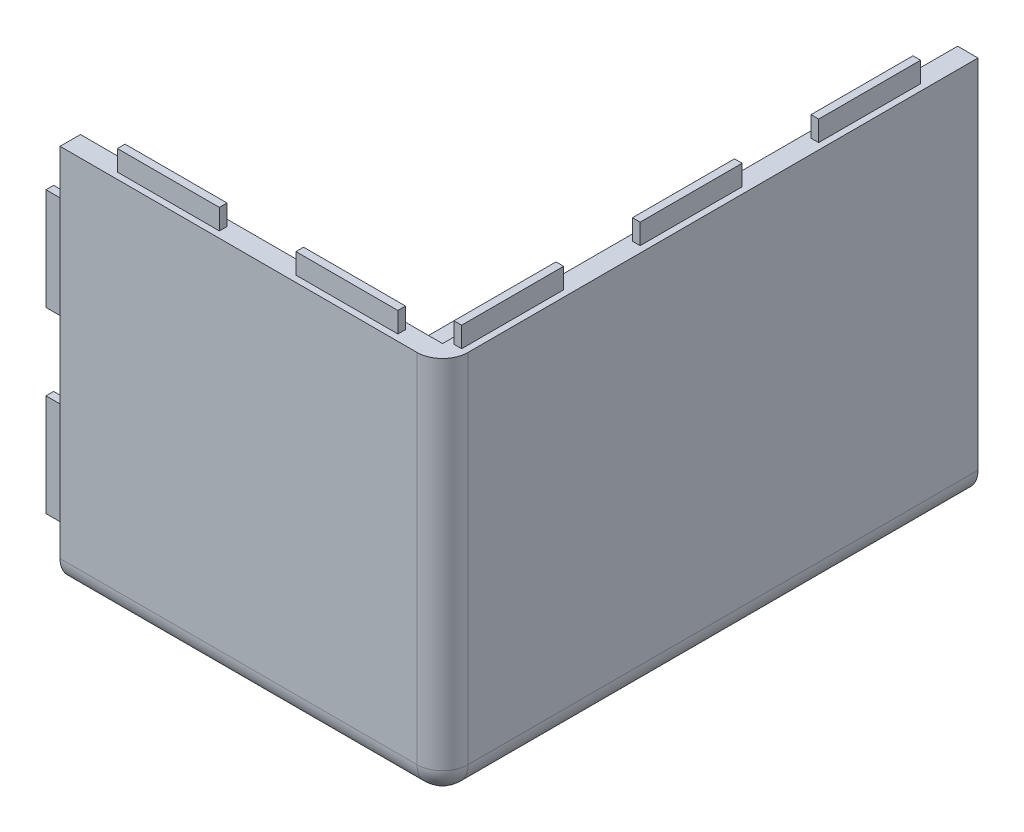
ISO-10303-21;
HEADER;
FILE_DESCRIPTION(('STEP AP214'),'2;1');
FILE_NAME('part.step','',(''),(''),'','','');
FILE_SCHEMA(('AUTOMOTIVE_DESIGN { 1 0 10303 214 1 1 1 1 }'));
ENDSEC;
DATA;
#1=APPLICATION_CONTEXT('core data for automotive mechanical design processes');
#2=APPLICATION_PROTOCOL_DEFINITION('international standard','automotive_design',2000,#1);
#3=PRODUCT_CONTEXT('',#1,'mechanical');
#4=PRODUCT('Part','Part','',(#3));
#5=PRODUCT_RELATED_PRODUCT_CATEGORY('part','',(#4));
#6=PRODUCT_DEFINITION_FORMATION('','',#4);
#7=PRODUCT_DEFINITION_CONTEXT('part definition',#1,'design');
#8=PRODUCT_DEFINITION('design','',#6,#7);
#9=PRODUCT_DEFINITION_SHAPE('','',#8);
#10=(LENGTH_UNIT() NAMED_UNIT(*) SI_UNIT(.MILLI.,.METRE.));
#11=(NAMED_UNIT(*) PLANE_ANGLE_UNIT() SI_UNIT($,.RADIAN.));
#12=(NAMED_UNIT(*) SI_UNIT($,.STERADIAN.) SOLID_ANGLE_UNIT());
#13=UNCERTAINTY_MEASURE_WITH_UNIT(LENGTH_MEASURE(1.E-05),#10,'distance_accuracy_value','');
#14=(GEOMETRIC_REPRESENTATION_CONTEXT(3) GLOBAL_UNCERTAINTY_ASSIGNED_CONTEXT((#13)) GLOBAL_UNIT_ASSIGNED_CONTEXT((#10,
#11,#12)) REPRESENTATION_CONTEXT('',''));
#15=CARTESIAN_POINT('',(0.,0.,0.));
#16=DIRECTION('',(0.,0.,1.));
#17=DIRECTION('',(1.,0.,0.));
#18=AXIS2_PLACEMENT_3D('',#15,#16,#17);
#19=CARTESIAN_POINT('',(0.,150.,0.));
#20=DIRECTION('',(1.,0.,0.));
#21=DIRECTION('',(0.,0.,-1.));
#22=AXIS2_PLACEMENT_3D('',#19,#20,#21);
#23=PLANE('',#22);
#24=DIRECTION('',(0.,-1.,0.));
#25=VECTOR('',#24,1.);
#26=CARTESIAN_POINT('',(0.,130.,-5.5));
#27=LINE('',#26,#25);
#28=CARTESIAN_POINT('',(0.,130.,-5.5));
#29=VERTEX_POINT('',#28);
#30=CARTESIAN_POINT('',(0.,90.,-5.5));
#31=VERTEX_POINT('',#30);
#32=EDGE_CURVE('E790',#29,#31,#27,.T.);
#33=ORIENTED_EDGE('',*,*,#32,.F.);
#34=DIRECTION('',(0.,0.,-1.));
#35=VECTOR('',#34,1.);
#36=CARTESIAN_POINT('',(0.,130.,-5.5));
#37=LINE('',#36,#35);
#38=CARTESIAN_POINT('',(0.,130.,-2.5));
#39=VERTEX_POINT('',#38);
#40=EDGE_CURVE('E777',#39,#29,#37,.T.);
#41=ORIENTED_EDGE('',*,*,#40,.F.);
#42=DIRECTION('',(0.,1.,0.));
#43=VECTOR('',#42,1.);
#44=CARTESIAN_POINT('',(0.,130.,-2.5));
#45=LINE('',#44,#43);
#46=CARTESIAN_POINT('',(0.,90.,-2.5));
#47=VERTEX_POINT('',#46);
#48=EDGE_CURVE('E781',#47,#39,#45,.T.);
#49=ORIENTED_EDGE('',*,*,#48,.F.);
#50=DIRECTION('',(0.,0.,1.));
#51=VECTOR('',#50,1.);
#52=CARTESIAN_POINT('',(0.,90.,-5.5));
#53=LINE('',#52,#51);
#54=EDGE_CURVE('E786',#31,#47,#53,.T.);
#55=ORIENTED_EDGE('',*,*,#54,.F.);
#56=EDGE_LOOP('',(#33,#41,#49,#55));
#57=FACE_BOUND('',#56,.T.);
#58=DIRECTION('',(0.,-1.,0.));
#59=VECTOR('',#58,1.);
#60=CARTESIAN_POINT('',(0.,2.5,-120.));
#61=LINE('',#60,#59);
#62=CARTESIAN_POINT('',(0.,5.5,-120.));
#63=VERTEX_POINT('',#62);
#64=CARTESIAN_POINT('',(0.,2.5,-120.));
#65=VERTEX_POINT('',#64);
#66=EDGE_CURVE('E880',#63,#65,#61,.T.);
#67=ORIENTED_EDGE('',*,*,#66,.F.);
#68=DIRECTION('',(0.,0.,-1.));
#69=VECTOR('',#68,1.);
#70=CARTESIAN_POINT('',(0.,5.5,-120.));
#71=LINE('',#70,#69);
#72=CARTESIAN_POINT('',(0.,5.50000000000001,-80.));
#73=VERTEX_POINT('',#72);
#74=EDGE_CURVE('E867',#73,#63,#71,.T.);
#75=ORIENTED_EDGE('',*,*,#74,.F.);
#76=DIRECTION('',(0.,1.,0.));
#77=VECTOR('',#76,1.);
#78=CARTESIAN_POINT('',(0.,2.5,-80.));
#79=LINE('',#78,#77);
#80=CARTESIAN_POINT('',(0.,2.5,-80.));
#81=VERTEX_POINT('',#80);
#82=EDGE_CURVE('E871',#81,#73,#79,.T.);
#83=ORIENTED_EDGE('',*,*,#82,.F.);
#84=DIRECTION('',(0.,0.,1.));
#85=VECTOR('',#84,1.);
#86=CARTESIAN_POINT('',(0.,2.5,-120.));
#87=LINE('',#86,#85);
#88=EDGE_CURVE('E876',#65,#81,#87,.T.);
#89=ORIENTED_EDGE('',*,*,#88,.F.);
#90=EDGE_LOOP('',(#67,#75,#83,#89));
#91=FACE_BOUND('',#90,.T.);
#92=DIRECTION('',(0.,0.,1.));
#93=VECTOR('',#92,1.);
#94=CARTESIAN_POINT('',(0.,0.,0.));
#95=LINE('',#94,#93);
#96=CARTESIAN_POINT('',(0.,0.,-210.));
#97=VERTEX_POINT('',#96);
#98=CARTESIAN_POINT('',(0.,0.,-10.));
#99=VERTEX_POINT('',#98);
#100=EDGE_CURVE('E1192',#97,#99,#95,.T.);
#101=ORIENTED_EDGE('',*,*,#100,.T.);
#102=CARTESIAN_POINT('',(0.,10.,-10.));
#103=DIRECTION('',(1.,0.,0.));
#104=DIRECTION('',(0.,0.,-1.));
#105=AXIS2_PLACEMENT_3D('',#102,#103,#104);
#106=CIRCLE('',#105,10.);
#107=CARTESIAN_POINT('',(0.,10.,0.));
#108=VERTEX_POINT('',#107);
#109=EDGE_CURVE('E57',#99,#108,#106,.F.);
#110=ORIENTED_EDGE('',*,*,#109,.T.);
#111=DIRECTION('',(0.,-1.,0.));
#112=VECTOR('',#111,1.);
#113=CARTESIAN_POINT('',(0.,150.,0.));
#114=LINE('',#113,#112);
#115=CARTESIAN_POINT('',(0.,150.,0.));
#116=VERTEX_POINT('',#115);
#117=EDGE_CURVE('E1225',#116,#108,#114,.T.);
#118=ORIENTED_EDGE('',*,*,#117,.F.);
#119=DIRECTION('',(0.,0.,1.));
#120=VECTOR('',#119,1.);
#121=CARTESIAN_POINT('',(0.,150.,0.));
#122=LINE('',#121,#120);
#123=CARTESIAN_POINT('',(0.,150.,-8.));
#124=VERTEX_POINT('',#123);
#125=EDGE_CURVE('E1198',#124,#116,#122,.T.);
#126=ORIENTED_EDGE('',*,*,#125,.F.);
#127=DIRECTION('',(0.,1.,0.));
#128=VECTOR('',#127,1.);
#129=CARTESIAN_POINT('',(0.,8.00000000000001,-8.00000000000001));
#130=LINE('',#129,#128);
#131=CARTESIAN_POINT('',(0.,8.00000000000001,-8.00000000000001));
#132=VERTEX_POINT('',#131);
#133=EDGE_CURVE('E1182',#132,#124,#130,.T.);
#134=ORIENTED_EDGE('',*,*,#133,.F.);
#135=DIRECTION('',(0.,0.,1.));
#136=VECTOR('',#135,1.);
#137=CARTESIAN_POINT('',(0.,8.00000000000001,-210.));
#138=LINE('',#137,#136);
#139=CARTESIAN_POINT('',(0.,8.00000000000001,-210.));
#140=VERTEX_POINT('',#139);
#141=EDGE_CURVE('E1166',#140,#132,#138,.T.);
#142=ORIENTED_EDGE('',*,*,#141,.F.);
#143=DIRECTION('',(0.,-1.,0.));
#144=VECTOR('',#143,1.);
#145=CARTESIAN_POINT('',(0.,150.,-210.));
#146=LINE('',#145,#144);
#147=EDGE_CURVE('E1213',#140,#97,#146,.T.);
#148=ORIENTED_EDGE('',*,*,#147,.T.);
#149=EDGE_LOOP('',(#101,#110,#118,#126,#134,#142,#148));
#150=FACE_BOUND('',#149,.T.);
#151=DIRECTION('',(0.,-1.,0.));
#152=VECTOR('',#151,1.);
#153=CARTESIAN_POINT('',(0.,5.5,-190.));
#154=LINE('',#153,#152);
#155=CARTESIAN_POINT('',(0.,5.5,-190.));
#156=VERTEX_POINT('',#155);
#157=CARTESIAN_POINT('',(0.,2.5,-190.));
#158=VERTEX_POINT('',#157);
#159=EDGE_CURVE('E884',#156,#158,#154,.T.);
#160=ORIENTED_EDGE('',*,*,#159,.F.);
#161=DIRECTION('',(0.,0.,-1.));
#162=VECTOR('',#161,1.);
#163=CARTESIAN_POINT('',(0.,5.5,-190.));
#164=LINE('',#163,#162);
#165=CARTESIAN_POINT('',(0.,5.50000000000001,-150.));
#166=VERTEX_POINT('',#165);
#167=EDGE_CURVE('E901',#166,#156,#164,.T.);
#168=ORIENTED_EDGE('',*,*,#167,.F.);
#169=DIRECTION('',(0.,1.,0.));
#170=VECTOR('',#169,1.);
#171=CARTESIAN_POINT('',(0.,5.5,-150.));
#172=LINE('',#171,#170);
#173=CARTESIAN_POINT('',(0.,2.5,-150.));
#174=VERTEX_POINT('',#173);
#175=EDGE_CURVE('E918',#174,#166,#172,.T.);
#176=ORIENTED_EDGE('',*,*,#175,.F.);
#177=DIRECTION('',(0.,0.,1.));
#178=VECTOR('',#177,1.);
#179=CARTESIAN_POINT('',(0.,2.5,-190.));
#180=LINE('',#179,#178);
#181=EDGE_CURVE('E914',#158,#174,#180,.T.);
#182=ORIENTED_EDGE('',*,*,#181,.F.);
#183=EDGE_LOOP('',(#160,#168,#176,#182));
#184=FACE_BOUND('',#183,.T.);
#185=DIRECTION('',(0.,-1.,0.));
#186=VECTOR('',#185,1.);
#187=CARTESIAN_POINT('',(0.,5.5,-50.));
#188=LINE('',#187,#186);
#189=CARTESIAN_POINT('',(0.,5.5,-50.));
#190=VERTEX_POINT('',#189);
#191=CARTESIAN_POINT('',(0.,2.5,-50.));
#192=VERTEX_POINT('',#191);
#193=EDGE_CURVE('E835',#190,#192,#188,.T.);
#194=ORIENTED_EDGE('',*,*,#193,.F.);
#195=DIRECTION('',(0.,0.,-1.));
#196=VECTOR('',#195,1.);
#197=CARTESIAN_POINT('',(0.,5.5,-50.));
#198=LINE('',#197,#196);
#199=CARTESIAN_POINT('',(0.,5.50000000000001,-9.99999999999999));
#200=VERTEX_POINT('',#199);
#201=EDGE_CURVE('E822',#200,#190,#198,.T.);
#202=ORIENTED_EDGE('',*,*,#201,.F.);
#203=DIRECTION('',(0.,1.,0.));
#204=VECTOR('',#203,1.);
#205=CARTESIAN_POINT('',(0.,5.5,-9.99999999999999));
#206=LINE('',#205,#204);
#207=CARTESIAN_POINT('',(0.,2.5,-9.99999999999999));
#208=VERTEX_POINT('',#207);
#209=EDGE_CURVE('E826',#208,#200,#206,.T.);
#210=ORIENTED_EDGE('',*,*,#209,.F.);
#211=DIRECTION('',(0.,0.,1.));
#212=VECTOR('',#211,1.);
#213=CARTESIAN_POINT('',(0.,2.5,-50.));
#214=LINE('',#213,#212);
#215=EDGE_CURVE('E831',#192,#208,#214,.T.);
#216=ORIENTED_EDGE('',*,*,#215,.F.);
#217=EDGE_LOOP('',(#194,#202,#210,#216));
#218=FACE_BOUND('',#217,.T.);
#219=DIRECTION('',(0.,-1.,0.));
#220=VECTOR('',#219,1.);
#221=CARTESIAN_POINT('',(0.,60.,-5.5));
#222=LINE('',#221,#220);
#223=CARTESIAN_POINT('',(0.,60.,-5.5));
#224=VERTEX_POINT('',#223);
#225=CARTESIAN_POINT('',(0.,20.,-5.49999999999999));
#226=VERTEX_POINT('',#225);
#227=EDGE_CURVE('E745',#224,#226,#222,.T.);
#228=ORIENTED_EDGE('',*,*,#227,.F.);
#229=DIRECTION('',(0.,0.,-1.));
#230=VECTOR('',#229,1.);
#231=CARTESIAN_POINT('',(0.,60.,-5.5));
#232=LINE('',#231,#230);
#233=CARTESIAN_POINT('',(0.,60.,-2.5));
#234=VERTEX_POINT('',#233);
#235=EDGE_CURVE('E732',#234,#224,#232,.T.);
#236=ORIENTED_EDGE('',*,*,#235,.F.);
#237=DIRECTION('',(0.,1.,0.));
#238=VECTOR('',#237,1.);
#239=CARTESIAN_POINT('',(0.,60.,-2.5));
#240=LINE('',#239,#238);
#241=CARTESIAN_POINT('',(0.,20.,-2.5));
#242=VERTEX_POINT('',#241);
#243=EDGE_CURVE('E736',#242,#234,#240,.T.);
#244=ORIENTED_EDGE('',*,*,#243,.F.);
#245=DIRECTION('',(0.,0.,1.));
#246=VECTOR('',#245,1.);
#247=CARTESIAN_POINT('',(0.,20.,-5.49999999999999));
#248=LINE('',#247,#246);
#249=EDGE_CURVE('E741',#226,#242,#248,.T.);
#250=ORIENTED_EDGE('',*,*,#249,.F.);
#251=EDGE_LOOP('',(#228,#236,#244,#250));
#252=FACE_BOUND('',#251,.T.);
#253=ADVANCED_FACE('F47',(#57,#91,#150,#184,#218,#252),#23,.F.);
#254=CARTESIAN_POINT('',(0.,150.,0.));
#255=DIRECTION('',(0.,-1.,0.));
#256=DIRECTION('',(0.,0.,-1.));
#257=AXIS2_PLACEMENT_3D('',#254,#255,#256);
#258=PLANE('',#257);
#259=DIRECTION('',(0.,0.,-1.));
#260=VECTOR('',#259,1.);
#261=CARTESIAN_POINT('',(147.5,150.,-120.));
#262=LINE('',#261,#260);
#263=CARTESIAN_POINT('',(147.5,150.,-80.));
#264=VERTEX_POINT('',#263);
#265=CARTESIAN_POINT('',(147.5,150.,-120.));
#266=VERTEX_POINT('',#265);
#267=EDGE_CURVE('E1015',#264,#266,#262,.T.);
#268=ORIENTED_EDGE('',*,*,#267,.F.);
#269=DIRECTION('',(1.,0.,0.));
#270=VECTOR('',#269,1.);
#271=CARTESIAN_POINT('',(147.5,150.,-80.));
#272=LINE('',#271,#270);
#273=CARTESIAN_POINT('',(144.5,150.,-80.));
#274=VERTEX_POINT('',#273);
#275=EDGE_CURVE('E1002',#274,#264,#272,.T.);
#276=ORIENTED_EDGE('',*,*,#275,.F.);
#277=DIRECTION('',(0.,0.,1.));
#278=VECTOR('',#277,1.);
#279=CARTESIAN_POINT('',(144.5,150.,-120.));
#280=LINE('',#279,#278);
#281=CARTESIAN_POINT('',(144.5,150.,-120.));
#282=VERTEX_POINT('',#281);
#283=EDGE_CURVE('E1006',#282,#274,#280,.T.);
#284=ORIENTED_EDGE('',*,*,#283,.F.);
#285=DIRECTION('',(-1.,0.,0.));
#286=VECTOR('',#285,1.);
#287=CARTESIAN_POINT('',(147.5,150.,-120.));
#288=LINE('',#287,#286);
#289=EDGE_CURVE('E1011',#266,#282,#288,.T.);
#290=ORIENTED_EDGE('',*,*,#289,.F.);
#291=EDGE_LOOP('',(#268,#276,#284,#290));
#292=FACE_BOUND('',#291,.T.);
#293=DIRECTION('',(0.,0.,1.));
#294=VECTOR('',#293,1.);
#295=CARTESIAN_POINT('',(90.,150.,-5.50000000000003));
#296=LINE('',#295,#294);
#297=CARTESIAN_POINT('',(90.,150.,-5.50000000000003));
#298=VERTEX_POINT('',#297);
#299=CARTESIAN_POINT('',(90.,150.,-2.50000000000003));
#300=VERTEX_POINT('',#299);
#301=EDGE_CURVE('E1105',#298,#300,#296,.T.);
#302=ORIENTED_EDGE('',*,*,#301,.F.);
#303=DIRECTION('',(-1.,0.,0.));
#304=VECTOR('',#303,1.);
#305=CARTESIAN_POINT('',(90.,150.,-5.50000000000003));
#306=LINE('',#305,#304);
#307=CARTESIAN_POINT('',(130.,150.,-5.50000000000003));
#308=VERTEX_POINT('',#307);
#309=EDGE_CURVE('E1092',#308,#298,#306,.T.);
#310=ORIENTED_EDGE('',*,*,#309,.F.);
#311=DIRECTION('',(0.,0.,-1.));
#312=VECTOR('',#311,1.);
#313=CARTESIAN_POINT('',(130.,150.,-5.50000000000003));
#314=LINE('',#313,#312);
#315=CARTESIAN_POINT('',(130.,150.,-2.50000000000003));
#316=VERTEX_POINT('',#315);
#317=EDGE_CURVE('E1096',#316,#308,#314,.T.);
#318=ORIENTED_EDGE('',*,*,#317,.F.);
#319=DIRECTION('',(1.,0.,0.));
#320=VECTOR('',#319,1.);
#321=CARTESIAN_POINT('',(90.,150.,-2.50000000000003));
#322=LINE('',#321,#320);
#323=EDGE_CURVE('E1101',#300,#316,#322,.T.);
#324=ORIENTED_EDGE('',*,*,#323,.F.);
#325=EDGE_LOOP('',(#302,#310,#318,#324));
#326=FACE_BOUND('',#325,.T.);
#327=DIRECTION('',(1.,0.,0.));
#328=VECTOR('',#327,1.);
#329=CARTESIAN_POINT('',(0.,150.,0.));
#330=LINE('',#329,#328);
#331=CARTESIAN_POINT('',(140.,150.,0.));
#332=VERTEX_POINT('',#331);
#333=EDGE_CURVE('E1201',#116,#332,#330,.T.);
#334=ORIENTED_EDGE('',*,*,#333,.T.);
#335=CARTESIAN_POINT('',(140.,150.,-10.));
#336=DIRECTION('',(0.,-1.,0.));
#337=DIRECTION('',(0.,0.,-1.));
#338=AXIS2_PLACEMENT_3D('',#335,#336,#337);
#339=CIRCLE('',#338,10.);
#340=CARTESIAN_POINT('',(150.,150.,-10.));
#341=VERTEX_POINT('',#340);
#342=EDGE_CURVE('E11',#332,#341,#339,.F.);
#343=ORIENTED_EDGE('',*,*,#342,.T.);
#344=DIRECTION('',(0.,0.,-1.));
#345=VECTOR('',#344,1.);
#346=CARTESIAN_POINT('',(150.,150.,0.));
#347=LINE('',#346,#345);
#348=CARTESIAN_POINT('',(150.,150.,-210.));
#349=VERTEX_POINT('',#348);
#350=EDGE_CURVE('E1206',#341,#349,#347,.T.);
#351=ORIENTED_EDGE('',*,*,#350,.T.);
#352=DIRECTION('',(-1.,0.,0.));
#353=VECTOR('',#352,1.);
#354=CARTESIAN_POINT('',(0.,150.,-210.));
#355=LINE('',#354,#353);
#356=CARTESIAN_POINT('',(142.,150.,-210.));
#357=VERTEX_POINT('',#356);
#358=EDGE_CURVE('E1209',#349,#357,#355,.T.);
#359=ORIENTED_EDGE('',*,*,#358,.T.);
#360=DIRECTION('',(0.,0.,-1.));
#361=VECTOR('',#360,1.);
#362=CARTESIAN_POINT('',(142.,150.,-210.));
#363=LINE('',#362,#361);
#364=CARTESIAN_POINT('',(142.,150.,-8.));
#365=VERTEX_POINT('',#364);
#366=EDGE_CURVE('E1171',#365,#357,#363,.T.);
#367=ORIENTED_EDGE('',*,*,#366,.F.);
#368=DIRECTION('',(1.,0.,0.));
#369=VECTOR('',#368,1.);
#370=CARTESIAN_POINT('',(0.,150.,-8.00000000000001));
#371=LINE('',#370,#369);
#372=EDGE_CURVE('E1165',#124,#365,#371,.T.);
#373=ORIENTED_EDGE('',*,*,#372,.F.);
#374=ORIENTED_EDGE('',*,*,#125,.T.);
#375=EDGE_LOOP('',(#334,#343,#351,#359,#367,#373,#374));
#376=FACE_BOUND('',#375,.T.);
#377=DIRECTION('',(0.,0.,1.));
#378=VECTOR('',#377,1.);
#379=CARTESIAN_POINT('',(20.,150.,-5.5));
#380=LINE('',#379,#378);
#381=CARTESIAN_POINT('',(20.,150.,-5.5));
#382=VERTEX_POINT('',#381);
#383=CARTESIAN_POINT('',(20.,150.,-2.5));
#384=VERTEX_POINT('',#383);
#385=EDGE_CURVE('E1109',#382,#384,#380,.T.);
#386=ORIENTED_EDGE('',*,*,#385,.F.);
#387=DIRECTION('',(-1.,0.,0.));
#388=VECTOR('',#387,1.);
#389=CARTESIAN_POINT('',(20.,150.,-5.5));
#390=LINE('',#389,#388);
#391=CARTESIAN_POINT('',(60.,150.,-5.50000000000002));
#392=VERTEX_POINT('',#391);
#393=EDGE_CURVE('E1126',#392,#382,#390,.T.);
#394=ORIENTED_EDGE('',*,*,#393,.F.);
#395=DIRECTION('',(0.,0.,-1.));
#396=VECTOR('',#395,1.);
#397=CARTESIAN_POINT('',(60.,150.,-5.50000000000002));
#398=LINE('',#397,#396);
#399=CARTESIAN_POINT('',(60.,150.,-2.5));
#400=VERTEX_POINT('',#399);
#401=EDGE_CURVE('E1143',#400,#392,#398,.T.);
#402=ORIENTED_EDGE('',*,*,#401,.F.);
#403=DIRECTION('',(1.,0.,0.));
#404=VECTOR('',#403,1.);
#405=CARTESIAN_POINT('',(20.,150.,-2.5));
#406=LINE('',#405,#404);
#407=EDGE_CURVE('E1139',#384,#400,#406,.T.);
#408=ORIENTED_EDGE('',*,*,#407,.F.);
#409=EDGE_LOOP('',(#386,#394,#402,#408));
#410=FACE_BOUND('',#409,.T.);
#411=DIRECTION('',(0.,0.,1.));
#412=VECTOR('',#411,1.);
#413=CARTESIAN_POINT('',(144.5,150.,-190.));
#414=LINE('',#413,#412);
#415=CARTESIAN_POINT('',(144.5,150.,-190.));
#416=VERTEX_POINT('',#415);
#417=CARTESIAN_POINT('',(144.5,150.,-150.));
#418=VERTEX_POINT('',#417);
#419=EDGE_CURVE('E1060',#416,#418,#414,.T.);
#420=ORIENTED_EDGE('',*,*,#419,.F.);
#421=DIRECTION('',(-1.,0.,0.));
#422=VECTOR('',#421,1.);
#423=CARTESIAN_POINT('',(144.5,150.,-190.));
#424=LINE('',#423,#422);
#425=CARTESIAN_POINT('',(147.5,150.,-190.));
#426=VERTEX_POINT('',#425);
#427=EDGE_CURVE('E1047',#426,#416,#424,.T.);
#428=ORIENTED_EDGE('',*,*,#427,.F.);
#429=DIRECTION('',(0.,0.,-1.));
#430=VECTOR('',#429,1.);
#431=CARTESIAN_POINT('',(147.5,150.,-190.));
#432=LINE('',#431,#430);
#433=CARTESIAN_POINT('',(147.5,150.,-150.));
#434=VERTEX_POINT('',#433);
#435=EDGE_CURVE('E1051',#434,#426,#432,.T.);
#436=ORIENTED_EDGE('',*,*,#435,.F.);
#437=DIRECTION('',(1.,0.,0.));
#438=VECTOR('',#437,1.);
#439=CARTESIAN_POINT('',(144.5,150.,-150.));
#440=LINE('',#439,#438);
#441=EDGE_CURVE('E1056',#418,#434,#440,.T.);
#442=ORIENTED_EDGE('',*,*,#441,.F.);
#443=EDGE_LOOP('',(#420,#428,#436,#442));
#444=FACE_BOUND('',#443,.T.);
#445=DIRECTION('',(0.,0.,-1.));
#446=VECTOR('',#445,1.);
#447=CARTESIAN_POINT('',(147.5,150.,-50.));
#448=LINE('',#447,#446);
#449=CARTESIAN_POINT('',(147.5,150.,-9.99999999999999));
#450=VERTEX_POINT('',#449);
#451=CARTESIAN_POINT('',(147.5,150.,-50.));
#452=VERTEX_POINT('',#451);
#453=EDGE_CURVE('E970',#450,#452,#448,.T.);
#454=ORIENTED_EDGE('',*,*,#453,.F.);
#455=DIRECTION('',(1.,0.,0.));
#456=VECTOR('',#455,1.);
#457=CARTESIAN_POINT('',(147.5,150.,-9.99999999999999));
#458=LINE('',#457,#456);
#459=CARTESIAN_POINT('',(144.5,150.,-9.99999999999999));
#460=VERTEX_POINT('',#459);
#461=EDGE_CURVE('E957',#460,#450,#458,.T.);
#462=ORIENTED_EDGE('',*,*,#461,.F.);
#463=DIRECTION('',(0.,0.,1.));
#464=VECTOR('',#463,1.);
#465=CARTESIAN_POINT('',(144.5,150.,-50.));
#466=LINE('',#465,#464);
#467=CARTESIAN_POINT('',(144.5,150.,-50.));
#468=VERTEX_POINT('',#467);
#469=EDGE_CURVE('E961',#468,#460,#466,.T.);
#470=ORIENTED_EDGE('',*,*,#469,.F.);
#471=DIRECTION('',(-1.,0.,0.));
#472=VECTOR('',#471,1.);
#473=CARTESIAN_POINT('',(147.5,150.,-50.));
#474=LINE('',#473,#472);
#475=EDGE_CURVE('E966',#452,#468,#474,.T.);
#476=ORIENTED_EDGE('',*,*,#475,.F.);
#477=EDGE_LOOP('',(#454,#462,#470,#476));
#478=FACE_BOUND('',#477,.T.);
#479=ADVANCED_FACE('F1282',(#292,#326,#376,#410,#444,#478),#258,.F.);
#480=CARTESIAN_POINT('',(0.,150.,0.));
#481=DIRECTION('',(0.,0.,-1.));
#482=DIRECTION('',(-1.,0.,0.));
#483=AXIS2_PLACEMENT_3D('',#480,#481,#482);
#484=PLANE('',#483);
#485=ORIENTED_EDGE('',*,*,#117,.T.);
#486=DIRECTION('',(1.,0.,0.));
#487=VECTOR('',#486,1.);
#488=CARTESIAN_POINT('',(150.,10.,0.));
#489=LINE('',#488,#487);
#490=CARTESIAN_POINT('',(140.,10.,0.));
#491=VERTEX_POINT('',#490);
#492=EDGE_CURVE('E65',#108,#491,#489,.T.);
#493=ORIENTED_EDGE('',*,*,#492,.T.);
#494=DIRECTION('',(0.,-1.,0.));
#495=VECTOR('',#494,1.);
#496=CARTESIAN_POINT('',(140.,150.,0.));
#497=LINE('',#496,#495);
#498=EDGE_CURVE('E1244',#491,#332,#497,.F.);
#499=ORIENTED_EDGE('',*,*,#498,.T.);
#500=ORIENTED_EDGE('',*,*,#333,.F.);
#501=EDGE_LOOP('',(#485,#493,#499,#500));
#502=FACE_BOUND('',#501,.T.);
#503=ADVANCED_FACE('F1289',(#502),#484,.F.);
#504=CARTESIAN_POINT('',(150.,150.,0.));
#505=DIRECTION('',(-1.,0.,0.));
#506=DIRECTION('',(0.,0.,1.));
#507=AXIS2_PLACEMENT_3D('',#504,#505,#506);
#508=PLANE('',#507);
#509=DIRECTION('',(0.,-1.,0.));
#510=VECTOR('',#509,1.);
#511=CARTESIAN_POINT('',(150.,150.,-10.));
#512=LINE('',#511,#510);
#513=CARTESIAN_POINT('',(150.,10.,-10.));
#514=VERTEX_POINT('',#513);
#515=EDGE_CURVE('E1228',#341,#514,#512,.T.);
#516=ORIENTED_EDGE('',*,*,#515,.T.);
#517=DIRECTION('',(0.,0.,-1.));
#518=VECTOR('',#517,1.);
#519=CARTESIAN_POINT('',(150.,10.,-210.));
#520=LINE('',#519,#518);
#521=CARTESIAN_POINT('',(150.,10.,-210.));
#522=VERTEX_POINT('',#521);
#523=EDGE_CURVE('E1231',#514,#522,#520,.T.);
#524=ORIENTED_EDGE('',*,*,#523,.T.);
#525=DIRECTION('',(0.,-1.,0.));
#526=VECTOR('',#525,1.);
#527=CARTESIAN_POINT('',(150.,150.,-210.));
#528=LINE('',#527,#526);
#529=EDGE_CURVE('E1221',#349,#522,#528,.T.);
#530=ORIENTED_EDGE('',*,*,#529,.F.);
#531=ORIENTED_EDGE('',*,*,#350,.F.);
#532=EDGE_LOOP('',(#516,#524,#530,#531));
#533=FACE_BOUND('',#532,.T.);
#534=ADVANCED_FACE('F1272',(#533),#508,.F.);
#535=CARTESIAN_POINT('',(0.,150.,-210.));
#536=DIRECTION('',(0.,0.,1.));
#537=DIRECTION('',(1.,0.,0.));
#538=AXIS2_PLACEMENT_3D('',#535,#536,#537);
#539=PLANE('',#538);
#540=DIRECTION('',(-1.,0.,0.));
#541=VECTOR('',#540,1.);
#542=CARTESIAN_POINT('',(147.5,90.,-210.));
#543=LINE('',#542,#541);
#544=CARTESIAN_POINT('',(147.5,90.,-210.));
#545=VERTEX_POINT('',#544);
#546=CARTESIAN_POINT('',(144.5,90.,-210.));
#547=VERTEX_POINT('',#546);
#548=EDGE_CURVE('E561',#545,#547,#543,.T.);
#549=ORIENTED_EDGE('',*,*,#548,.F.);
#550=DIRECTION('',(0.,-1.,0.));
#551=VECTOR('',#550,1.);
#552=CARTESIAN_POINT('',(147.5,130.,-210.));
#553=LINE('',#552,#551);
#554=CARTESIAN_POINT('',(147.5,130.,-210.));
#555=VERTEX_POINT('',#554);
#556=EDGE_CURVE('E558',#555,#545,#553,.T.);
#557=ORIENTED_EDGE('',*,*,#556,.F.);
#558=DIRECTION('',(1.,0.,0.));
#559=VECTOR('',#558,1.);
#560=CARTESIAN_POINT('',(147.5,130.,-210.));
#561=LINE('',#560,#559);
#562=CARTESIAN_POINT('',(144.5,130.,-210.));
#563=VERTEX_POINT('',#562);
#564=EDGE_CURVE('E545',#563,#555,#561,.T.);
#565=ORIENTED_EDGE('',*,*,#564,.F.);
#566=DIRECTION('',(0.,1.,0.));
#567=VECTOR('',#566,1.);
#568=CARTESIAN_POINT('',(144.5,130.,-210.));
#569=LINE('',#568,#567);
#570=EDGE_CURVE('E566',#547,#563,#569,.T.);
#571=ORIENTED_EDGE('',*,*,#570,.F.);
#572=EDGE_LOOP('',(#549,#557,#565,#571));
#573=FACE_BOUND('',#572,.T.);
#574=DIRECTION('',(-1.,0.,0.));
#575=VECTOR('',#574,1.);
#576=CARTESIAN_POINT('',(147.5,20.,-210.));
#577=LINE('',#576,#575);
#578=CARTESIAN_POINT('',(147.5,20.,-210.));
#579=VERTEX_POINT('',#578);
#580=CARTESIAN_POINT('',(144.5,20.,-210.));
#581=VERTEX_POINT('',#580);
#582=EDGE_CURVE('E610',#579,#581,#577,.T.);
#583=ORIENTED_EDGE('',*,*,#582,.F.);
#584=DIRECTION('',(0.,-1.,0.));
#585=VECTOR('',#584,1.);
#586=CARTESIAN_POINT('',(147.5,60.,-210.));
#587=LINE('',#586,#585);
#588=CARTESIAN_POINT('',(147.5,60.,-210.));
#589=VERTEX_POINT('',#588);
#590=EDGE_CURVE('E562',#589,#579,#587,.T.);
#591=ORIENTED_EDGE('',*,*,#590,.F.);
#592=DIRECTION('',(1.,0.,0.));
#593=VECTOR('',#592,1.);
#594=CARTESIAN_POINT('',(147.5,60.,-210.));
#595=LINE('',#594,#593);
#596=CARTESIAN_POINT('',(144.5,60.,-210.));
#597=VERTEX_POINT('',#596);
#598=EDGE_CURVE('E601',#597,#589,#595,.T.);
#599=ORIENTED_EDGE('',*,*,#598,.F.);
#600=DIRECTION('',(0.,1.,0.));
#601=VECTOR('',#600,1.);
#602=CARTESIAN_POINT('',(144.5,60.,-210.));
#603=LINE('',#602,#601);
#604=EDGE_CURVE('E605',#581,#597,#603,.T.);
#605=ORIENTED_EDGE('',*,*,#604,.F.);
#606=EDGE_LOOP('',(#583,#591,#599,#605));
#607=FACE_BOUND('',#606,.T.);
#608=DIRECTION('',(-1.,0.,0.));
#609=VECTOR('',#608,1.);
#610=CARTESIAN_POINT('',(130.,2.5,-210.));
#611=LINE('',#610,#609);
#612=CARTESIAN_POINT('',(130.,2.5,-210.));
#613=VERTEX_POINT('',#612);
#614=CARTESIAN_POINT('',(90.,2.5,-210.));
#615=VERTEX_POINT('',#614);
#616=EDGE_CURVE('E654',#613,#615,#611,.T.);
#617=ORIENTED_EDGE('',*,*,#616,.F.);
#618=DIRECTION('',(0.,-1.,0.));
#619=VECTOR('',#618,1.);
#620=CARTESIAN_POINT('',(130.,5.5,-210.));
#621=LINE('',#620,#619);
#622=CARTESIAN_POINT('',(130.,5.5,-210.));
#623=VERTEX_POINT('',#622);
#624=EDGE_CURVE('E600',#623,#613,#621,.T.);
#625=ORIENTED_EDGE('',*,*,#624,.F.);
#626=DIRECTION('',(1.,0.,0.));
#627=VECTOR('',#626,1.);
#628=CARTESIAN_POINT('',(130.,5.5,-210.));
#629=LINE('',#628,#627);
#630=CARTESIAN_POINT('',(90.,5.50000000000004,-210.));
#631=VERTEX_POINT('',#630);
#632=EDGE_CURVE('E645',#631,#623,#629,.T.);
#633=ORIENTED_EDGE('',*,*,#632,.F.);
#634=DIRECTION('',(0.,1.,0.));
#635=VECTOR('',#634,1.);
#636=CARTESIAN_POINT('',(90.,5.50000000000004,-210.));
#637=LINE('',#636,#635);
#638=EDGE_CURVE('E649',#615,#631,#637,.T.);
#639=ORIENTED_EDGE('',*,*,#638,.F.);
#640=EDGE_LOOP('',(#617,#625,#633,#639));
#641=FACE_BOUND('',#640,.T.);
#642=DIRECTION('',(-1.,0.,0.));
#643=VECTOR('',#642,1.);
#644=CARTESIAN_POINT('',(60.,2.5,-210.));
#645=LINE('',#644,#643);
#646=CARTESIAN_POINT('',(60.,2.5,-210.));
#647=VERTEX_POINT('',#646);
#648=CARTESIAN_POINT('',(20.,2.5,-210.));
#649=VERTEX_POINT('',#648);
#650=EDGE_CURVE('E696',#647,#649,#645,.T.);
#651=ORIENTED_EDGE('',*,*,#650,.F.);
#652=DIRECTION('',(0.,-1.,0.));
#653=VECTOR('',#652,1.);
#654=CARTESIAN_POINT('',(60.,5.5,-210.));
#655=LINE('',#654,#653);
#656=CARTESIAN_POINT('',(60.,5.5,-210.));
#657=VERTEX_POINT('',#656);
#658=EDGE_CURVE('E644',#657,#647,#655,.T.);
#659=ORIENTED_EDGE('',*,*,#658,.F.);
#660=DIRECTION('',(1.,0.,0.));
#661=VECTOR('',#660,1.);
#662=CARTESIAN_POINT('',(60.,5.5,-210.));
#663=LINE('',#662,#661);
#664=CARTESIAN_POINT('',(20.,5.5,-210.));
#665=VERTEX_POINT('',#664);
#666=EDGE_CURVE('E687',#665,#657,#663,.T.);
#667=ORIENTED_EDGE('',*,*,#666,.F.);
#668=DIRECTION('',(0.,1.,0.));
#669=VECTOR('',#668,1.);
#670=CARTESIAN_POINT('',(20.,5.5,-210.));
#671=LINE('',#670,#669);
#672=EDGE_CURVE('E691',#649,#665,#671,.T.);
#673=ORIENTED_EDGE('',*,*,#672,.F.);
#674=EDGE_LOOP('',(#651,#659,#667,#673));
#675=FACE_BOUND('',#674,.T.);
#676=ORIENTED_EDGE('',*,*,#529,.T.);
#677=CARTESIAN_POINT('',(140.,10.,-210.));
#678=DIRECTION('',(0.,0.,1.));
#679=DIRECTION('',(1.,0.,0.));
#680=AXIS2_PLACEMENT_3D('',#677,#678,#679);
#681=CIRCLE('',#680,10.);
#682=CARTESIAN_POINT('',(140.,0.,-210.));
#683=VERTEX_POINT('',#682);
#684=EDGE_CURVE('E1235',#522,#683,#681,.F.);
#685=ORIENTED_EDGE('',*,*,#684,.T.);
#686=DIRECTION('',(-1.,0.,0.));
#687=VECTOR('',#686,1.);
#688=CARTESIAN_POINT('',(0.,0.,-210.));
#689=LINE('',#688,#687);
#690=EDGE_CURVE('E1202',#683,#97,#689,.T.);
#691=ORIENTED_EDGE('',*,*,#690,.T.);
#692=ORIENTED_EDGE('',*,*,#147,.F.);
#693=DIRECTION('',(-1.,0.,0.));
#694=VECTOR('',#693,1.);
#695=CARTESIAN_POINT('',(0.,8.00000000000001,-210.));
#696=LINE('',#695,#694);
#697=CARTESIAN_POINT('',(142.,8.00000000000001,-210.));
#698=VERTEX_POINT('',#697);
#699=EDGE_CURVE('E1179',#698,#140,#696,.T.);
#700=ORIENTED_EDGE('',*,*,#699,.F.);
#701=DIRECTION('',(0.,1.,0.));
#702=VECTOR('',#701,1.);
#703=CARTESIAN_POINT('',(142.,8.00000000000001,-210.));
#704=LINE('',#703,#702);
#705=EDGE_CURVE('E1188',#698,#357,#704,.T.);
#706=ORIENTED_EDGE('',*,*,#705,.T.);
#707=ORIENTED_EDGE('',*,*,#358,.F.);
#708=EDGE_LOOP('',(#676,#685,#691,#692,#700,#706,#707));
#709=FACE_BOUND('',#708,.T.);
#710=ADVANCED_FACE('F1277',(#573,#607,#641,#675,#709),#539,.F.);
#711=CARTESIAN_POINT('',(0.,0.,0.));
#712=DIRECTION('',(0.,-1.,0.));
#713=DIRECTION('',(0.,0.,-1.));
#714=AXIS2_PLACEMENT_3D('',#711,#712,#713);
#715=PLANE('',#714);
#716=DIRECTION('',(0.,0.,1.));
#717=VECTOR('',#716,1.);
#718=CARTESIAN_POINT('',(50.,0.,-160.));
#719=LINE('',#718,#717);
#720=CARTESIAN_POINT('',(50.,0.,-160.));
#721=VERTEX_POINT('',#720);
#722=CARTESIAN_POINT('',(50.,0.,-100.));
#723=VERTEX_POINT('',#722);
#724=EDGE_CURVE('E488',#721,#723,#719,.T.);
#725=ORIENTED_EDGE('',*,*,#724,.T.);
#726=DIRECTION('',(1.,0.,0.));
#727=VECTOR('',#726,1.);
#728=CARTESIAN_POINT('',(50.,0.,-100.));
#729=LINE('',#728,#727);
#730=CARTESIAN_POINT('',(80.,0.,-100.));
#731=VERTEX_POINT('',#730);
#732=EDGE_CURVE('E501',#723,#731,#729,.T.);
#733=ORIENTED_EDGE('',*,*,#732,.T.);
#734=DIRECTION('',(0.,0.,-1.));
#735=VECTOR('',#734,1.);
#736=CARTESIAN_POINT('',(80.,0.,-160.));
#737=LINE('',#736,#735);
#738=CARTESIAN_POINT('',(80.,0.,-160.));
#739=VERTEX_POINT('',#738);
#740=EDGE_CURVE('E506',#731,#739,#737,.T.);
#741=ORIENTED_EDGE('',*,*,#740,.T.);
#742=DIRECTION('',(-1.,0.,0.));
#743=VECTOR('',#742,1.);
#744=CARTESIAN_POINT('',(50.,0.,-160.));
#745=LINE('',#744,#743);
#746=EDGE_CURVE('E497',#739,#721,#745,.T.);
#747=ORIENTED_EDGE('',*,*,#746,.T.);
#748=EDGE_LOOP('',(#725,#733,#741,#747));
#749=FACE_BOUND('',#748,.T.);
#750=ORIENTED_EDGE('',*,*,#690,.F.);
#751=DIRECTION('',(0.,0.,-1.));
#752=VECTOR('',#751,1.);
#753=CARTESIAN_POINT('',(140.,0.,0.));
#754=LINE('',#753,#752);
#755=CARTESIAN_POINT('',(140.,0.,-10.));
#756=VERTEX_POINT('',#755);
#757=EDGE_CURVE('E1241',#683,#756,#754,.F.);
#758=ORIENTED_EDGE('',*,*,#757,.T.);
#759=DIRECTION('',(1.,0.,0.));
#760=VECTOR('',#759,1.);
#761=CARTESIAN_POINT('',(0.,0.,-10.));
#762=LINE('',#761,#760);
#763=EDGE_CURVE('E1238',#756,#99,#762,.F.);
#764=ORIENTED_EDGE('',*,*,#763,.T.);
#765=ORIENTED_EDGE('',*,*,#100,.F.);
#766=EDGE_LOOP('',(#750,#758,#764,#765));
#767=FACE_BOUND('',#766,.T.);
#768=ADVANCED_FACE('F508',(#749,#767),#715,.T.);
#769=CARTESIAN_POINT('',(142.,8.00000000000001,-210.));
#770=DIRECTION('',(1.,0.,0.));
#771=DIRECTION('',(0.,0.,-1.));
#772=AXIS2_PLACEMENT_3D('',#769,#770,#771);
#773=PLANE('',#772);
#774=ORIENTED_EDGE('',*,*,#366,.T.);
#775=ORIENTED_EDGE('',*,*,#705,.F.);
#776=DIRECTION('',(0.,0.,-1.));
#777=VECTOR('',#776,1.);
#778=CARTESIAN_POINT('',(142.,8.00000000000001,-210.));
#779=LINE('',#778,#777);
#780=CARTESIAN_POINT('',(142.,8.00000000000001,-8.));
#781=VERTEX_POINT('',#780);
#782=EDGE_CURVE('E1175',#781,#698,#779,.T.);
#783=ORIENTED_EDGE('',*,*,#782,.F.);
#784=DIRECTION('',(0.,1.,0.));
#785=VECTOR('',#784,1.);
#786=CARTESIAN_POINT('',(142.,8.00000000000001,-8.));
#787=LINE('',#786,#785);
#788=EDGE_CURVE('E1193',#781,#365,#787,.T.);
#789=ORIENTED_EDGE('',*,*,#788,.T.);
#790=EDGE_LOOP('',(#774,#775,#783,#789));
#791=FACE_BOUND('',#790,.T.);
#792=ADVANCED_FACE('F1300',(#791),#773,.F.);
#793=CARTESIAN_POINT('',(0.,8.00000000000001,-8.00000000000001));
#794=DIRECTION('',(0.,0.,1.));
#795=DIRECTION('',(1.,0.,0.));
#796=AXIS2_PLACEMENT_3D('',#793,#794,#795);
#797=PLANE('',#796);
#798=ORIENTED_EDGE('',*,*,#372,.T.);
#799=ORIENTED_EDGE('',*,*,#788,.F.);
#800=DIRECTION('',(1.,0.,0.));
#801=VECTOR('',#800,1.);
#802=CARTESIAN_POINT('',(0.,8.00000000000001,-8.00000000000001));
#803=LINE('',#802,#801);
#804=EDGE_CURVE('E1170',#132,#781,#803,.T.);
#805=ORIENTED_EDGE('',*,*,#804,.F.);
#806=ORIENTED_EDGE('',*,*,#133,.T.);
#807=EDGE_LOOP('',(#798,#799,#805,#806));
#808=FACE_BOUND('',#807,.T.);
#809=ADVANCED_FACE('F1302',(#808),#797,.F.);
#810=CARTESIAN_POINT('',(0.,8.00000000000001,0.));
#811=DIRECTION('',(0.,1.,0.));
#812=DIRECTION('',(0.,0.,1.));
#813=AXIS2_PLACEMENT_3D('',#810,#811,#812);
#814=PLANE('',#813);
#815=DIRECTION('',(0.,0.,1.));
#816=VECTOR('',#815,1.);
#817=CARTESIAN_POINT('',(50.,8.00000000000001,-160.));
#818=LINE('',#817,#816);
#819=CARTESIAN_POINT('',(50.,8.00000000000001,-160.));
#820=VERTEX_POINT('',#819);
#821=CARTESIAN_POINT('',(50.,8.00000000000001,-100.));
#822=VERTEX_POINT('',#821);
#823=EDGE_CURVE('E491',#820,#822,#818,.T.);
#824=ORIENTED_EDGE('',*,*,#823,.F.);
#825=DIRECTION('',(-1.,0.,0.));
#826=VECTOR('',#825,1.);
#827=CARTESIAN_POINT('',(50.,8.00000000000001,-160.));
#828=LINE('',#827,#826);
#829=CARTESIAN_POINT('',(80.,8.00000000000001,-160.));
#830=VERTEX_POINT('',#829);
#831=EDGE_CURVE('E512',#830,#820,#828,.T.);
#832=ORIENTED_EDGE('',*,*,#831,.F.);
#833=DIRECTION('',(0.,0.,-1.));
#834=VECTOR('',#833,1.);
#835=CARTESIAN_POINT('',(80.,8.00000000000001,-160.));
#836=LINE('',#835,#834);
#837=CARTESIAN_POINT('',(80.,8.00000000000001,-100.));
#838=VERTEX_POINT('',#837);
#839=EDGE_CURVE('E516',#838,#830,#836,.T.);
#840=ORIENTED_EDGE('',*,*,#839,.F.);
#841=DIRECTION('',(1.,0.,0.));
#842=VECTOR('',#841,1.);
#843=CARTESIAN_POINT('',(50.,8.00000000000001,-100.));
#844=LINE('',#843,#842);
#845=EDGE_CURVE('E525',#822,#838,#844,.T.);
#846=ORIENTED_EDGE('',*,*,#845,.F.);
#847=EDGE_LOOP('',(#824,#832,#840,#846));
#848=FACE_BOUND('',#847,.T.);
#849=ORIENTED_EDGE('',*,*,#141,.T.);
#850=ORIENTED_EDGE('',*,*,#804,.T.);
#851=ORIENTED_EDGE('',*,*,#782,.T.);
#852=ORIENTED_EDGE('',*,*,#699,.T.);
#853=EDGE_LOOP('',(#849,#850,#851,#852));
#854=FACE_BOUND('',#853,.T.);
#855=ADVANCED_FACE('F1297',(#848,#854),#814,.T.);
#856=CARTESIAN_POINT('',(20.,158.,-5.5));
#857=DIRECTION('',(1.,0.,0.));
#858=DIRECTION('',(0.,0.,-1.));
#859=AXIS2_PLACEMENT_3D('',#856,#857,#858);
#860=PLANE('',#859);
#861=ORIENTED_EDGE('',*,*,#385,.T.);
#862=DIRECTION('',(0.,-1.,0.));
#863=VECTOR('',#862,1.);
#864=CARTESIAN_POINT('',(20.,158.,-2.5));
#865=LINE('',#864,#863);
#866=CARTESIAN_POINT('',(20.,158.,-2.5));
#867=VERTEX_POINT('',#866);
#868=EDGE_CURVE('E1161',#867,#384,#865,.T.);
#869=ORIENTED_EDGE('',*,*,#868,.F.);
#870=DIRECTION('',(0.,0.,1.));
#871=VECTOR('',#870,1.);
#872=CARTESIAN_POINT('',(20.,158.,-5.5));
#873=LINE('',#872,#871);
#874=CARTESIAN_POINT('',(20.,158.,-5.5));
#875=VERTEX_POINT('',#874);
#876=EDGE_CURVE('E1121',#875,#867,#873,.T.);
#877=ORIENTED_EDGE('',*,*,#876,.F.);
#878=DIRECTION('',(0.,-1.,0.));
#879=VECTOR('',#878,1.);
#880=CARTESIAN_POINT('',(20.,158.,-5.5));
#881=LINE('',#880,#879);
#882=EDGE_CURVE('E1135',#875,#382,#881,.T.);
#883=ORIENTED_EDGE('',*,*,#882,.T.);
#884=EDGE_LOOP('',(#861,#869,#877,#883));
#885=FACE_BOUND('',#884,.T.);
#886=ADVANCED_FACE('F1310',(#885),#860,.F.);
#887=CARTESIAN_POINT('',(20.,158.,-2.5));
#888=DIRECTION('',(0.,0.,-1.));
#889=DIRECTION('',(-1.,0.,0.));
#890=AXIS2_PLACEMENT_3D('',#887,#888,#889);
#891=PLANE('',#890);
#892=ORIENTED_EDGE('',*,*,#407,.T.);
#893=DIRECTION('',(0.,-1.,0.));
#894=VECTOR('',#893,1.);
#895=CARTESIAN_POINT('',(60.,158.,-2.5));
#896=LINE('',#895,#894);
#897=CARTESIAN_POINT('',(60.,158.,-2.5));
#898=VERTEX_POINT('',#897);
#899=EDGE_CURVE('E1157',#898,#400,#896,.T.);
#900=ORIENTED_EDGE('',*,*,#899,.F.);
#901=DIRECTION('',(1.,0.,0.));
#902=VECTOR('',#901,1.);
#903=CARTESIAN_POINT('',(20.,158.,-2.5));
#904=LINE('',#903,#902);
#905=EDGE_CURVE('E1125',#867,#898,#904,.T.);
#906=ORIENTED_EDGE('',*,*,#905,.F.);
#907=ORIENTED_EDGE('',*,*,#868,.T.);
#908=EDGE_LOOP('',(#892,#900,#906,#907));
#909=FACE_BOUND('',#908,.T.);
#910=ADVANCED_FACE('F1620',(#909),#891,.F.);
#911=CARTESIAN_POINT('',(60.,158.,-5.50000000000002));
#912=DIRECTION('',(-1.,0.,0.));
#913=DIRECTION('',(0.,0.,1.));
#914=AXIS2_PLACEMENT_3D('',#911,#912,#913);
#915=PLANE('',#914);
#916=ORIENTED_EDGE('',*,*,#401,.T.);
#917=DIRECTION('',(0.,-1.,0.));
#918=VECTOR('',#917,1.);
#919=CARTESIAN_POINT('',(60.,158.,-5.50000000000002));
#920=LINE('',#919,#918);
#921=CARTESIAN_POINT('',(60.,158.,-5.50000000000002));
#922=VERTEX_POINT('',#921);
#923=EDGE_CURVE('E1153',#922,#392,#920,.T.);
#924=ORIENTED_EDGE('',*,*,#923,.F.);
#925=DIRECTION('',(0.,0.,-1.));
#926=VECTOR('',#925,1.);
#927=CARTESIAN_POINT('',(60.,158.,-5.50000000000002));
#928=LINE('',#927,#926);
#929=EDGE_CURVE('E1129',#898,#922,#928,.T.);
#930=ORIENTED_EDGE('',*,*,#929,.F.);
#931=ORIENTED_EDGE('',*,*,#899,.T.);
#932=EDGE_LOOP('',(#916,#924,#930,#931));
#933=FACE_BOUND('',#932,.T.);
#934=ADVANCED_FACE('F1616',(#933),#915,.F.);
#935=CARTESIAN_POINT('',(20.,158.,-5.5));
#936=DIRECTION('',(0.,0.,1.));
#937=DIRECTION('',(1.,0.,0.));
#938=AXIS2_PLACEMENT_3D('',#935,#936,#937);
#939=PLANE('',#938);
#940=ORIENTED_EDGE('',*,*,#393,.T.);
#941=ORIENTED_EDGE('',*,*,#882,.F.);
#942=DIRECTION('',(-1.,0.,0.));
#943=VECTOR('',#942,1.);
#944=CARTESIAN_POINT('',(20.,158.,-5.5));
#945=LINE('',#944,#943);
#946=EDGE_CURVE('E1132',#922,#875,#945,.T.);
#947=ORIENTED_EDGE('',*,*,#946,.F.);
#948=ORIENTED_EDGE('',*,*,#923,.T.);
#949=EDGE_LOOP('',(#940,#941,#947,#948));
#950=FACE_BOUND('',#949,.T.);
#951=ADVANCED_FACE('F1612',(#950),#939,.F.);
#952=CARTESIAN_POINT('',(0.,158.,0.));
#953=DIRECTION('',(0.,1.,0.));
#954=DIRECTION('',(0.,0.,1.));
#955=AXIS2_PLACEMENT_3D('',#952,#953,#954);
#956=PLANE('',#955);
#957=ORIENTED_EDGE('',*,*,#876,.T.);
#958=ORIENTED_EDGE('',*,*,#905,.T.);
#959=ORIENTED_EDGE('',*,*,#929,.T.);
#960=ORIENTED_EDGE('',*,*,#946,.T.);
#961=EDGE_LOOP('',(#957,#958,#959,#960));
#962=FACE_BOUND('',#961,.T.);
#963=ADVANCED_FACE('F1594',(#962),#956,.T.);
#964=CARTESIAN_POINT('',(90.,158.,-5.50000000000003));
#965=DIRECTION('',(1.,0.,0.));
#966=DIRECTION('',(0.,0.,-1.));
#967=AXIS2_PLACEMENT_3D('',#964,#965,#966);
#968=PLANE('',#967);
#969=ORIENTED_EDGE('',*,*,#301,.T.);
#970=DIRECTION('',(0.,-1.,0.));
#971=VECTOR('',#970,1.);
#972=CARTESIAN_POINT('',(90.,158.,-2.50000000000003));
#973=LINE('',#972,#971);
#974=CARTESIAN_POINT('',(90.,158.,-2.50000000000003));
#975=VERTEX_POINT('',#974);
#976=EDGE_CURVE('E1064',#975,#300,#973,.T.);
#977=ORIENTED_EDGE('',*,*,#976,.F.);
#978=DIRECTION('',(0.,0.,1.));
#979=VECTOR('',#978,1.);
#980=CARTESIAN_POINT('',(90.,158.,-5.50000000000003));
#981=LINE('',#980,#979);
#982=CARTESIAN_POINT('',(90.,158.,-5.50000000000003));
#983=VERTEX_POINT('',#982);
#984=EDGE_CURVE('E1097',#983,#975,#981,.T.);
#985=ORIENTED_EDGE('',*,*,#984,.F.);
#986=DIRECTION('',(0.,-1.,0.));
#987=VECTOR('',#986,1.);
#988=CARTESIAN_POINT('',(90.,158.,-5.50000000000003));
#989=LINE('',#988,#987);
#990=EDGE_CURVE('E1087',#983,#298,#989,.T.);
#991=ORIENTED_EDGE('',*,*,#990,.T.);
#992=EDGE_LOOP('',(#969,#977,#985,#991));
#993=FACE_BOUND('',#992,.T.);
#994=ADVANCED_FACE('F1590',(#993),#968,.F.);
#995=CARTESIAN_POINT('',(90.,158.,-2.50000000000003));
#996=DIRECTION('',(0.,0.,-1.));
#997=DIRECTION('',(-1.,0.,0.));
#998=AXIS2_PLACEMENT_3D('',#995,#996,#997);
#999=PLANE('',#998);
#1000=ORIENTED_EDGE('',*,*,#323,.T.);
#1001=DIRECTION('',(0.,-1.,0.));
#1002=VECTOR('',#1001,1.);
#1003=CARTESIAN_POINT('',(130.,158.,-2.50000000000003));
#1004=LINE('',#1003,#1002);
#1005=CARTESIAN_POINT('',(130.,158.,-2.50000000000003));
#1006=VERTEX_POINT('',#1005);
#1007=EDGE_CURVE('E1079',#1006,#316,#1004,.T.);
#1008=ORIENTED_EDGE('',*,*,#1007,.F.);
#1009=DIRECTION('',(1.,0.,0.));
#1010=VECTOR('',#1009,1.);
#1011=CARTESIAN_POINT('',(90.,158.,-2.50000000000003));
#1012=LINE('',#1011,#1010);
#1013=EDGE_CURVE('E1115',#975,#1006,#1012,.T.);
#1014=ORIENTED_EDGE('',*,*,#1013,.F.);
#1015=ORIENTED_EDGE('',*,*,#976,.T.);
#1016=EDGE_LOOP('',(#1000,#1008,#1014,#1015));
#1017=FACE_BOUND('',#1016,.T.);
#1018=ADVANCED_FACE('F1593',(#1017),#999,.F.);
#1019=CARTESIAN_POINT('',(130.,158.,-5.50000000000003));
#1020=DIRECTION('',(-1.,0.,0.));
#1021=DIRECTION('',(0.,0.,1.));
#1022=AXIS2_PLACEMENT_3D('',#1019,#1020,#1021);
#1023=PLANE('',#1022);
#1024=ORIENTED_EDGE('',*,*,#317,.T.);
#1025=DIRECTION('',(0.,-1.,0.));
#1026=VECTOR('',#1025,1.);
#1027=CARTESIAN_POINT('',(130.,158.,-5.50000000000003));
#1028=LINE('',#1027,#1026);
#1029=CARTESIAN_POINT('',(130.,158.,-5.50000000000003));
#1030=VERTEX_POINT('',#1029);
#1031=EDGE_CURVE('E1083',#1030,#308,#1028,.T.);
#1032=ORIENTED_EDGE('',*,*,#1031,.F.);
#1033=DIRECTION('',(0.,0.,-1.));
#1034=VECTOR('',#1033,1.);
#1035=CARTESIAN_POINT('',(130.,158.,-5.50000000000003));
#1036=LINE('',#1035,#1034);
#1037=EDGE_CURVE('E1112',#1006,#1030,#1036,.T.);
#1038=ORIENTED_EDGE('',*,*,#1037,.F.);
#1039=ORIENTED_EDGE('',*,*,#1007,.T.);
#1040=EDGE_LOOP('',(#1024,#1032,#1038,#1039));
#1041=FACE_BOUND('',#1040,.T.);
#1042=ADVANCED_FACE('F1598',(#1041),#1023,.F.);
#1043=CARTESIAN_POINT('',(90.,158.,-5.50000000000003));
#1044=DIRECTION('',(0.,0.,1.));
#1045=DIRECTION('',(1.,0.,0.));
#1046=AXIS2_PLACEMENT_3D('',#1043,#1044,#1045);
#1047=PLANE('',#1046);
#1048=ORIENTED_EDGE('',*,*,#309,.T.);
#1049=ORIENTED_EDGE('',*,*,#990,.F.);
#1050=DIRECTION('',(-1.,0.,0.));
#1051=VECTOR('',#1050,1.);
#1052=CARTESIAN_POINT('',(90.,158.,-5.50000000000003));
#1053=LINE('',#1052,#1051);
#1054=EDGE_CURVE('E1091',#1030,#983,#1053,.T.);
#1055=ORIENTED_EDGE('',*,*,#1054,.F.);
#1056=ORIENTED_EDGE('',*,*,#1031,.T.);
#1057=EDGE_LOOP('',(#1048,#1049,#1055,#1056));
#1058=FACE_BOUND('',#1057,.T.);
#1059=ADVANCED_FACE('F1602',(#1058),#1047,.F.);
#1060=CARTESIAN_POINT('',(0.,158.,0.));
#1061=DIRECTION('',(0.,1.,0.));
#1062=DIRECTION('',(0.,0.,1.));
#1063=AXIS2_PLACEMENT_3D('',#1060,#1061,#1062);
#1064=PLANE('',#1063);
#1065=ORIENTED_EDGE('',*,*,#984,.T.);
#1066=ORIENTED_EDGE('',*,*,#1013,.T.);
#1067=ORIENTED_EDGE('',*,*,#1037,.T.);
#1068=ORIENTED_EDGE('',*,*,#1054,.T.);
#1069=EDGE_LOOP('',(#1065,#1066,#1067,#1068));
#1070=FACE_BOUND('',#1069,.T.);
#1071=ADVANCED_FACE('F1574',(#1070),#1064,.T.);
#1072=CARTESIAN_POINT('',(144.5,158.,-190.));
#1073=DIRECTION('',(1.,0.,0.));
#1074=DIRECTION('',(0.,0.,-1.));
#1075=AXIS2_PLACEMENT_3D('',#1072,#1073,#1074);
#1076=PLANE('',#1075);
#1077=ORIENTED_EDGE('',*,*,#419,.T.);
#1078=DIRECTION('',(0.,-1.,0.));
#1079=VECTOR('',#1078,1.);
#1080=CARTESIAN_POINT('',(144.5,158.,-150.));
#1081=LINE('',#1080,#1079);
#1082=CARTESIAN_POINT('',(144.5,158.,-150.));
#1083=VERTEX_POINT('',#1082);
#1084=EDGE_CURVE('E1019',#1083,#418,#1081,.T.);
#1085=ORIENTED_EDGE('',*,*,#1084,.F.);
#1086=DIRECTION('',(0.,0.,1.));
#1087=VECTOR('',#1086,1.);
#1088=CARTESIAN_POINT('',(144.5,158.,-190.));
#1089=LINE('',#1088,#1087);
#1090=CARTESIAN_POINT('',(144.5,158.,-190.));
#1091=VERTEX_POINT('',#1090);
#1092=EDGE_CURVE('E1052',#1091,#1083,#1089,.T.);
#1093=ORIENTED_EDGE('',*,*,#1092,.F.);
#1094=DIRECTION('',(0.,-1.,0.));
#1095=VECTOR('',#1094,1.);
#1096=CARTESIAN_POINT('',(144.5,158.,-190.));
#1097=LINE('',#1096,#1095);
#1098=EDGE_CURVE('E1042',#1091,#416,#1097,.T.);
#1099=ORIENTED_EDGE('',*,*,#1098,.T.);
#1100=EDGE_LOOP('',(#1077,#1085,#1093,#1099));
#1101=FACE_BOUND('',#1100,.T.);
#1102=ADVANCED_FACE('F1570',(#1101),#1076,.F.);
#1103=CARTESIAN_POINT('',(144.5,158.,-150.));
#1104=DIRECTION('',(0.,0.,-1.));
#1105=DIRECTION('',(-1.,0.,0.));
#1106=AXIS2_PLACEMENT_3D('',#1103,#1104,#1105);
#1107=PLANE('',#1106);
#1108=ORIENTED_EDGE('',*,*,#441,.T.);
#1109=DIRECTION('',(0.,-1.,0.));
#1110=VECTOR('',#1109,1.);
#1111=CARTESIAN_POINT('',(147.5,158.,-150.));
#1112=LINE('',#1111,#1110);
#1113=CARTESIAN_POINT('',(147.5,158.,-150.));
#1114=VERTEX_POINT('',#1113);
#1115=EDGE_CURVE('E1034',#1114,#434,#1112,.T.);
#1116=ORIENTED_EDGE('',*,*,#1115,.F.);
#1117=DIRECTION('',(1.,0.,0.));
#1118=VECTOR('',#1117,1.);
#1119=CARTESIAN_POINT('',(144.5,158.,-150.));
#1120=LINE('',#1119,#1118);
#1121=EDGE_CURVE('E1070',#1083,#1114,#1120,.T.);
#1122=ORIENTED_EDGE('',*,*,#1121,.F.);
#1123=ORIENTED_EDGE('',*,*,#1084,.T.);
#1124=EDGE_LOOP('',(#1108,#1116,#1122,#1123));
#1125=FACE_BOUND('',#1124,.T.);
#1126=ADVANCED_FACE('F1573',(#1125),#1107,.F.);
#1127=CARTESIAN_POINT('',(147.5,158.,-190.));
#1128=DIRECTION('',(-1.,0.,0.));
#1129=DIRECTION('',(0.,0.,1.));
#1130=AXIS2_PLACEMENT_3D('',#1127,#1128,#1129);
#1131=PLANE('',#1130);
#1132=ORIENTED_EDGE('',*,*,#435,.T.);
#1133=DIRECTION('',(0.,-1.,0.));
#1134=VECTOR('',#1133,1.);
#1135=CARTESIAN_POINT('',(147.5,158.,-190.));
#1136=LINE('',#1135,#1134);
#1137=CARTESIAN_POINT('',(147.5,158.,-190.));
#1138=VERTEX_POINT('',#1137);
#1139=EDGE_CURVE('E1038',#1138,#426,#1136,.T.);
#1140=ORIENTED_EDGE('',*,*,#1139,.F.);
#1141=DIRECTION('',(0.,0.,-1.));
#1142=VECTOR('',#1141,1.);
#1143=CARTESIAN_POINT('',(147.5,158.,-190.));
#1144=LINE('',#1143,#1142);
#1145=EDGE_CURVE('E1067',#1114,#1138,#1144,.T.);
#1146=ORIENTED_EDGE('',*,*,#1145,.F.);
#1147=ORIENTED_EDGE('',*,*,#1115,.T.);
#1148=EDGE_LOOP('',(#1132,#1140,#1146,#1147));
#1149=FACE_BOUND('',#1148,.T.);
#1150=ADVANCED_FACE('F1578',(#1149),#1131,.F.);
#1151=CARTESIAN_POINT('',(144.5,158.,-190.));
#1152=DIRECTION('',(0.,0.,1.));
#1153=DIRECTION('',(1.,0.,0.));
#1154=AXIS2_PLACEMENT_3D('',#1151,#1152,#1153);
#1155=PLANE('',#1154);
#1156=ORIENTED_EDGE('',*,*,#427,.T.);
#1157=ORIENTED_EDGE('',*,*,#1098,.F.);
#1158=DIRECTION('',(-1.,0.,0.));
#1159=VECTOR('',#1158,1.);
#1160=CARTESIAN_POINT('',(144.5,158.,-190.));
#1161=LINE('',#1160,#1159);
#1162=EDGE_CURVE('E1046',#1138,#1091,#1161,.T.);
#1163=ORIENTED_EDGE('',*,*,#1162,.F.);
#1164=ORIENTED_EDGE('',*,*,#1139,.T.);
#1165=EDGE_LOOP('',(#1156,#1157,#1163,#1164));
#1166=FACE_BOUND('',#1165,.T.);
#1167=ADVANCED_FACE('F1582',(#1166),#1155,.F.);
#1168=CARTESIAN_POINT('',(0.,158.,0.));
#1169=DIRECTION('',(0.,1.,0.));
#1170=DIRECTION('',(0.,0.,1.));
#1171=AXIS2_PLACEMENT_3D('',#1168,#1169,#1170);
#1172=PLANE('',#1171);
#1173=ORIENTED_EDGE('',*,*,#1092,.T.);
#1174=ORIENTED_EDGE('',*,*,#1121,.T.);
#1175=ORIENTED_EDGE('',*,*,#1145,.T.);
#1176=ORIENTED_EDGE('',*,*,#1162,.T.);
#1177=EDGE_LOOP('',(#1173,#1174,#1175,#1176));
#1178=FACE_BOUND('',#1177,.T.);
#1179=ADVANCED_FACE('F1554',(#1178),#1172,.T.);
#1180=CARTESIAN_POINT('',(147.5,158.,-120.));
#1181=DIRECTION('',(-1.,0.,0.));
#1182=DIRECTION('',(0.,0.,1.));
#1183=AXIS2_PLACEMENT_3D('',#1180,#1181,#1182);
#1184=PLANE('',#1183);
#1185=ORIENTED_EDGE('',*,*,#267,.T.);
#1186=DIRECTION('',(0.,-1.,0.));
#1187=VECTOR('',#1186,1.);
#1188=CARTESIAN_POINT('',(147.5,158.,-120.));
#1189=LINE('',#1188,#1187);
#1190=CARTESIAN_POINT('',(147.5,158.,-120.));
#1191=VERTEX_POINT('',#1190);
#1192=EDGE_CURVE('E974',#1191,#266,#1189,.T.);
#1193=ORIENTED_EDGE('',*,*,#1192,.F.);
#1194=DIRECTION('',(0.,0.,-1.));
#1195=VECTOR('',#1194,1.);
#1196=CARTESIAN_POINT('',(147.5,158.,-120.));
#1197=LINE('',#1196,#1195);
#1198=CARTESIAN_POINT('',(147.5,158.,-80.));
#1199=VERTEX_POINT('',#1198);
#1200=EDGE_CURVE('E1007',#1199,#1191,#1197,.T.);
#1201=ORIENTED_EDGE('',*,*,#1200,.F.);
#1202=DIRECTION('',(0.,-1.,0.));
#1203=VECTOR('',#1202,1.);
#1204=CARTESIAN_POINT('',(147.5,158.,-80.));
#1205=LINE('',#1204,#1203);
#1206=EDGE_CURVE('E997',#1199,#264,#1205,.T.);
#1207=ORIENTED_EDGE('',*,*,#1206,.T.);
#1208=EDGE_LOOP('',(#1185,#1193,#1201,#1207));
#1209=FACE_BOUND('',#1208,.T.);
#1210=ADVANCED_FACE('F1550',(#1209),#1184,.F.);
#1211=CARTESIAN_POINT('',(147.5,158.,-120.));
#1212=DIRECTION('',(0.,0.,1.));
#1213=DIRECTION('',(1.,0.,0.));
#1214=AXIS2_PLACEMENT_3D('',#1211,#1212,#1213);
#1215=PLANE('',#1214);
#1216=ORIENTED_EDGE('',*,*,#289,.T.);
#1217=DIRECTION('',(0.,-1.,0.));
#1218=VECTOR('',#1217,1.);
#1219=CARTESIAN_POINT('',(144.5,158.,-120.));
#1220=LINE('',#1219,#1218);
#1221=CARTESIAN_POINT('',(144.5,158.,-120.));
#1222=VERTEX_POINT('',#1221);
#1223=EDGE_CURVE('E989',#1222,#282,#1220,.T.);
#1224=ORIENTED_EDGE('',*,*,#1223,.F.);
#1225=DIRECTION('',(-1.,0.,0.));
#1226=VECTOR('',#1225,1.);
#1227=CARTESIAN_POINT('',(147.5,158.,-120.));
#1228=LINE('',#1227,#1226);
#1229=EDGE_CURVE('E1025',#1191,#1222,#1228,.T.);
#1230=ORIENTED_EDGE('',*,*,#1229,.F.);
#1231=ORIENTED_EDGE('',*,*,#1192,.T.);
#1232=EDGE_LOOP('',(#1216,#1224,#1230,#1231));
#1233=FACE_BOUND('',#1232,.T.);
#1234=ADVANCED_FACE('F1553',(#1233),#1215,.F.);
#1235=CARTESIAN_POINT('',(144.5,158.,-120.));
#1236=DIRECTION('',(1.,0.,0.));
#1237=DIRECTION('',(0.,0.,-1.));
#1238=AXIS2_PLACEMENT_3D('',#1235,#1236,#1237);
#1239=PLANE('',#1238);
#1240=ORIENTED_EDGE('',*,*,#283,.T.);
#1241=DIRECTION('',(0.,-1.,0.));
#1242=VECTOR('',#1241,1.);
#1243=CARTESIAN_POINT('',(144.5,158.,-80.));
#1244=LINE('',#1243,#1242);
#1245=CARTESIAN_POINT('',(144.5,158.,-80.));
#1246=VERTEX_POINT('',#1245);
#1247=EDGE_CURVE('E993',#1246,#274,#1244,.T.);
#1248=ORIENTED_EDGE('',*,*,#1247,.F.);
#1249=DIRECTION('',(0.,0.,1.));
#1250=VECTOR('',#1249,1.);
#1251=CARTESIAN_POINT('',(144.5,158.,-120.));
#1252=LINE('',#1251,#1250);
#1253=EDGE_CURVE('E1022',#1222,#1246,#1252,.T.);
#1254=ORIENTED_EDGE('',*,*,#1253,.F.);
#1255=ORIENTED_EDGE('',*,*,#1223,.T.);
#1256=EDGE_LOOP('',(#1240,#1248,#1254,#1255));
#1257=FACE_BOUND('',#1256,.T.);
#1258=ADVANCED_FACE('F1558',(#1257),#1239,.F.);
#1259=CARTESIAN_POINT('',(147.5,158.,-80.));
#1260=DIRECTION('',(0.,0.,-1.));
#1261=DIRECTION('',(-1.,0.,0.));
#1262=AXIS2_PLACEMENT_3D('',#1259,#1260,#1261);
#1263=PLANE('',#1262);
#1264=ORIENTED_EDGE('',*,*,#275,.T.);
#1265=ORIENTED_EDGE('',*,*,#1206,.F.);
#1266=DIRECTION('',(1.,0.,0.));
#1267=VECTOR('',#1266,1.);
#1268=CARTESIAN_POINT('',(147.5,158.,-80.));
#1269=LINE('',#1268,#1267);
#1270=EDGE_CURVE('E1001',#1246,#1199,#1269,.T.);
#1271=ORIENTED_EDGE('',*,*,#1270,.F.);
#1272=ORIENTED_EDGE('',*,*,#1247,.T.);
#1273=EDGE_LOOP('',(#1264,#1265,#1271,#1272));
#1274=FACE_BOUND('',#1273,.T.);
#1275=ADVANCED_FACE('F1562',(#1274),#1263,.F.);
#1276=CARTESIAN_POINT('',(0.,158.,0.));
#1277=DIRECTION('',(0.,-1.,0.));
#1278=DIRECTION('',(0.,0.,-1.));
#1279=AXIS2_PLACEMENT_3D('',#1276,#1277,#1278);
#1280=PLANE('',#1279);
#1281=ORIENTED_EDGE('',*,*,#1200,.T.);
#1282=ORIENTED_EDGE('',*,*,#1229,.T.);
#1283=ORIENTED_EDGE('',*,*,#1253,.T.);
#1284=ORIENTED_EDGE('',*,*,#1270,.T.);
#1285=EDGE_LOOP('',(#1281,#1282,#1283,#1284));
#1286=FACE_BOUND('',#1285,.T.);
#1287=ADVANCED_FACE('F1534',(#1286),#1280,.F.);
#1288=CARTESIAN_POINT('',(147.5,158.,-50.));
#1289=DIRECTION('',(-1.,0.,0.));
#1290=DIRECTION('',(0.,0.,1.));
#1291=AXIS2_PLACEMENT_3D('',#1288,#1289,#1290);
#1292=PLANE('',#1291);
#1293=ORIENTED_EDGE('',*,*,#453,.T.);
#1294=DIRECTION('',(0.,-1.,0.));
#1295=VECTOR('',#1294,1.);
#1296=CARTESIAN_POINT('',(147.5,158.,-50.));
#1297=LINE('',#1296,#1295);
#1298=CARTESIAN_POINT('',(147.5,158.,-50.));
#1299=VERTEX_POINT('',#1298);
#1300=EDGE_CURVE('E940',#1299,#452,#1297,.T.);
#1301=ORIENTED_EDGE('',*,*,#1300,.F.);
#1302=DIRECTION('',(0.,0.,-1.));
#1303=VECTOR('',#1302,1.);
#1304=CARTESIAN_POINT('',(147.5,158.,-50.));
#1305=LINE('',#1304,#1303);
#1306=CARTESIAN_POINT('',(147.5,158.,-9.99999999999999));
#1307=VERTEX_POINT('',#1306);
#1308=EDGE_CURVE('E962',#1307,#1299,#1305,.T.);
#1309=ORIENTED_EDGE('',*,*,#1308,.F.);
#1310=DIRECTION('',(0.,-1.,0.));
#1311=VECTOR('',#1310,1.);
#1312=CARTESIAN_POINT('',(147.5,158.,-9.99999999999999));
#1313=LINE('',#1312,#1311);
#1314=EDGE_CURVE('E952',#1307,#450,#1313,.T.);
#1315=ORIENTED_EDGE('',*,*,#1314,.T.);
#1316=EDGE_LOOP('',(#1293,#1301,#1309,#1315));
#1317=FACE_BOUND('',#1316,.T.);
#1318=ADVANCED_FACE('F1530',(#1317),#1292,.F.);
#1319=CARTESIAN_POINT('',(147.5,158.,-50.));
#1320=DIRECTION('',(0.,0.,1.));
#1321=DIRECTION('',(1.,0.,0.));
#1322=AXIS2_PLACEMENT_3D('',#1319,#1320,#1321);
#1323=PLANE('',#1322);
#1324=ORIENTED_EDGE('',*,*,#475,.T.);
#1325=DIRECTION('',(0.,-1.,0.));
#1326=VECTOR('',#1325,1.);
#1327=CARTESIAN_POINT('',(144.5,158.,-50.));
#1328=LINE('',#1327,#1326);
#1329=CARTESIAN_POINT('',(144.5,158.,-50.));
#1330=VERTEX_POINT('',#1329);
#1331=EDGE_CURVE('E944',#1330,#468,#1328,.T.);
#1332=ORIENTED_EDGE('',*,*,#1331,.F.);
#1333=DIRECTION('',(-1.,0.,0.));
#1334=VECTOR('',#1333,1.);
#1335=CARTESIAN_POINT('',(147.5,158.,-50.));
#1336=LINE('',#1335,#1334);
#1337=EDGE_CURVE('E980',#1299,#1330,#1336,.T.);
#1338=ORIENTED_EDGE('',*,*,#1337,.F.);
#1339=ORIENTED_EDGE('',*,*,#1300,.T.);
#1340=EDGE_LOOP('',(#1324,#1332,#1338,#1339));
#1341=FACE_BOUND('',#1340,.T.);
#1342=ADVANCED_FACE('F1533',(#1341),#1323,.F.);
#1343=CARTESIAN_POINT('',(144.5,158.,-50.));
#1344=DIRECTION('',(1.,0.,0.));
#1345=DIRECTION('',(0.,0.,-1.));
#1346=AXIS2_PLACEMENT_3D('',#1343,#1344,#1345);
#1347=PLANE('',#1346);
#1348=ORIENTED_EDGE('',*,*,#469,.T.);
#1349=DIRECTION('',(0.,-1.,0.));
#1350=VECTOR('',#1349,1.);
#1351=CARTESIAN_POINT('',(144.5,158.,-9.99999999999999));
#1352=LINE('',#1351,#1350);
#1353=CARTESIAN_POINT('',(144.5,158.,-9.99999999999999));
#1354=VERTEX_POINT('',#1353);
#1355=EDGE_CURVE('E948',#1354,#460,#1352,.T.);
#1356=ORIENTED_EDGE('',*,*,#1355,.F.);
#1357=DIRECTION('',(0.,0.,1.));
#1358=VECTOR('',#1357,1.);
#1359=CARTESIAN_POINT('',(144.5,158.,-50.));
#1360=LINE('',#1359,#1358);
#1361=EDGE_CURVE('E977',#1330,#1354,#1360,.T.);
#1362=ORIENTED_EDGE('',*,*,#1361,.F.);
#1363=ORIENTED_EDGE('',*,*,#1331,.T.);
#1364=EDGE_LOOP('',(#1348,#1356,#1362,#1363));
#1365=FACE_BOUND('',#1364,.T.);
#1366=ADVANCED_FACE('F1538',(#1365),#1347,.F.);
#1367=CARTESIAN_POINT('',(147.5,158.,-9.99999999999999));
#1368=DIRECTION('',(0.,0.,-1.));
#1369=DIRECTION('',(-1.,0.,0.));
#1370=AXIS2_PLACEMENT_3D('',#1367,#1368,#1369);
#1371=PLANE('',#1370);
#1372=ORIENTED_EDGE('',*,*,#461,.T.);
#1373=ORIENTED_EDGE('',*,*,#1314,.F.);
#1374=DIRECTION('',(1.,0.,0.));
#1375=VECTOR('',#1374,1.);
#1376=CARTESIAN_POINT('',(147.5,158.,-9.99999999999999));
#1377=LINE('',#1376,#1375);
#1378=EDGE_CURVE('E956',#1354,#1307,#1377,.T.);
#1379=ORIENTED_EDGE('',*,*,#1378,.F.);
#1380=ORIENTED_EDGE('',*,*,#1355,.T.);
#1381=EDGE_LOOP('',(#1372,#1373,#1379,#1380));
#1382=FACE_BOUND('',#1381,.T.);
#1383=ADVANCED_FACE('F1542',(#1382),#1371,.F.);
#1384=CARTESIAN_POINT('',(0.,158.,0.));
#1385=DIRECTION('',(0.,-1.,0.));
#1386=DIRECTION('',(0.,0.,-1.));
#1387=AXIS2_PLACEMENT_3D('',#1384,#1385,#1386);
#1388=PLANE('',#1387);
#1389=ORIENTED_EDGE('',*,*,#1308,.T.);
#1390=ORIENTED_EDGE('',*,*,#1337,.T.);
#1391=ORIENTED_EDGE('',*,*,#1361,.T.);
#1392=ORIENTED_EDGE('',*,*,#1378,.T.);
#1393=EDGE_LOOP('',(#1389,#1390,#1391,#1392));
#1394=FACE_BOUND('',#1393,.T.);
#1395=ADVANCED_FACE('F1528',(#1394),#1388,.F.);
#1396=CARTESIAN_POINT('',(-8.,5.5,-190.));
#1397=DIRECTION('',(0.,0.,1.));
#1398=DIRECTION('',(1.,0.,0.));
#1399=AXIS2_PLACEMENT_3D('',#1396,#1397,#1398);
#1400=PLANE('',#1399);
#1401=ORIENTED_EDGE('',*,*,#159,.T.);
#1402=DIRECTION('',(1.,0.,0.));
#1403=VECTOR('',#1402,1.);
#1404=CARTESIAN_POINT('',(-8.,2.5,-190.));
#1405=LINE('',#1404,#1403);
#1406=CARTESIAN_POINT('',(-8.,2.5,-190.));
#1407=VERTEX_POINT('',#1406);
#1408=EDGE_CURVE('E936',#1407,#158,#1405,.T.);
#1409=ORIENTED_EDGE('',*,*,#1408,.F.);
#1410=DIRECTION('',(0.,-1.,0.));
#1411=VECTOR('',#1410,1.);
#1412=CARTESIAN_POINT('',(-8.,5.5,-190.));
#1413=LINE('',#1412,#1411);
#1414=CARTESIAN_POINT('',(-8.,5.5,-190.));
#1415=VERTEX_POINT('',#1414);
#1416=EDGE_CURVE('E896',#1415,#1407,#1413,.T.);
#1417=ORIENTED_EDGE('',*,*,#1416,.F.);
#1418=DIRECTION('',(1.,0.,0.));
#1419=VECTOR('',#1418,1.);
#1420=CARTESIAN_POINT('',(-8.,5.5,-190.));
#1421=LINE('',#1420,#1419);
#1422=EDGE_CURVE('E910',#1415,#156,#1421,.T.);
#1423=ORIENTED_EDGE('',*,*,#1422,.T.);
#1424=EDGE_LOOP('',(#1401,#1409,#1417,#1423));
#1425=FACE_BOUND('',#1424,.T.);
#1426=ADVANCED_FACE('F1524',(#1425),#1400,.F.);
#1427=CARTESIAN_POINT('',(-8.,2.5,-190.));
#1428=DIRECTION('',(0.,1.,0.));
#1429=DIRECTION('',(0.,0.,1.));
#1430=AXIS2_PLACEMENT_3D('',#1427,#1428,#1429);
#1431=PLANE('',#1430);
#1432=ORIENTED_EDGE('',*,*,#181,.T.);
#1433=DIRECTION('',(1.,0.,0.));
#1434=VECTOR('',#1433,1.);
#1435=CARTESIAN_POINT('',(-8.,2.5,-150.));
#1436=LINE('',#1435,#1434);
#1437=CARTESIAN_POINT('',(-8.,2.5,-150.));
#1438=VERTEX_POINT('',#1437);
#1439=EDGE_CURVE('E932',#1438,#174,#1436,.T.);
#1440=ORIENTED_EDGE('',*,*,#1439,.F.);
#1441=DIRECTION('',(0.,0.,1.));
#1442=VECTOR('',#1441,1.);
#1443=CARTESIAN_POINT('',(-8.,2.5,-190.));
#1444=LINE('',#1443,#1442);
#1445=EDGE_CURVE('E900',#1407,#1438,#1444,.T.);
#1446=ORIENTED_EDGE('',*,*,#1445,.F.);
#1447=ORIENTED_EDGE('',*,*,#1408,.T.);
#1448=EDGE_LOOP('',(#1432,#1440,#1446,#1447));
#1449=FACE_BOUND('',#1448,.T.);
#1450=ADVANCED_FACE('F1520',(#1449),#1431,.F.);
#1451=CARTESIAN_POINT('',(-8.,5.5,-150.));
#1452=DIRECTION('',(0.,0.,-1.));
#1453=DIRECTION('',(-1.,0.,0.));
#1454=AXIS2_PLACEMENT_3D('',#1451,#1452,#1453);
#1455=PLANE('',#1454);
#1456=ORIENTED_EDGE('',*,*,#175,.T.);
#1457=DIRECTION('',(1.,0.,0.));
#1458=VECTOR('',#1457,1.);
#1459=CARTESIAN_POINT('',(-8.,5.5,-150.));
#1460=LINE('',#1459,#1458);
#1461=CARTESIAN_POINT('',(-8.,5.5,-150.));
#1462=VERTEX_POINT('',#1461);
#1463=EDGE_CURVE('E928',#1462,#166,#1460,.T.);
#1464=ORIENTED_EDGE('',*,*,#1463,.F.);
#1465=DIRECTION('',(0.,1.,0.));
#1466=VECTOR('',#1465,1.);
#1467=CARTESIAN_POINT('',(-8.,5.5,-150.));
#1468=LINE('',#1467,#1466);
#1469=EDGE_CURVE('E904',#1438,#1462,#1468,.T.);
#1470=ORIENTED_EDGE('',*,*,#1469,.F.);
#1471=ORIENTED_EDGE('',*,*,#1439,.T.);
#1472=EDGE_LOOP('',(#1456,#1464,#1470,#1471));
#1473=FACE_BOUND('',#1472,.T.);
#1474=ADVANCED_FACE('F1516',(#1473),#1455,.F.);
#1475=CARTESIAN_POINT('',(-8.,5.5,-190.));
#1476=DIRECTION('',(0.,-1.,0.));
#1477=DIRECTION('',(0.,0.,-1.));
#1478=AXIS2_PLACEMENT_3D('',#1475,#1476,#1477);
#1479=PLANE('',#1478);
#1480=ORIENTED_EDGE('',*,*,#167,.T.);
#1481=ORIENTED_EDGE('',*,*,#1422,.F.);
#1482=DIRECTION('',(0.,0.,-1.));
#1483=VECTOR('',#1482,1.);
#1484=CARTESIAN_POINT('',(-8.,5.5,-190.));
#1485=LINE('',#1484,#1483);
#1486=EDGE_CURVE('E907',#1462,#1415,#1485,.T.);
#1487=ORIENTED_EDGE('',*,*,#1486,.F.);
#1488=ORIENTED_EDGE('',*,*,#1463,.T.);
#1489=EDGE_LOOP('',(#1480,#1481,#1487,#1488));
#1490=FACE_BOUND('',#1489,.T.);
#1491=ADVANCED_FACE('F1512',(#1490),#1479,.F.);
#1492=CARTESIAN_POINT('',(-8.,0.,0.));
#1493=DIRECTION('',(-1.,0.,0.));
#1494=DIRECTION('',(0.,0.,1.));
#1495=AXIS2_PLACEMENT_3D('',#1492,#1493,#1494);
#1496=PLANE('',#1495);
#1497=ORIENTED_EDGE('',*,*,#1416,.T.);
#1498=ORIENTED_EDGE('',*,*,#1445,.T.);
#1499=ORIENTED_EDGE('',*,*,#1469,.T.);
#1500=ORIENTED_EDGE('',*,*,#1486,.T.);
#1501=EDGE_LOOP('',(#1497,#1498,#1499,#1500));
#1502=FACE_BOUND('',#1501,.T.);
#1503=ADVANCED_FACE('F1494',(#1502),#1496,.T.);
#1504=CARTESIAN_POINT('',(-8.,2.5,-120.));
#1505=DIRECTION('',(0.,0.,1.));
#1506=DIRECTION('',(1.,0.,0.));
#1507=AXIS2_PLACEMENT_3D('',#1504,#1505,#1506);
#1508=PLANE('',#1507);
#1509=ORIENTED_EDGE('',*,*,#66,.T.);
#1510=DIRECTION('',(1.,0.,0.));
#1511=VECTOR('',#1510,1.);
#1512=CARTESIAN_POINT('',(-8.,2.5,-120.));
#1513=LINE('',#1512,#1511);
#1514=CARTESIAN_POINT('',(-8.,2.5,-120.));
#1515=VERTEX_POINT('',#1514);
#1516=EDGE_CURVE('E839',#1515,#65,#1513,.T.);
#1517=ORIENTED_EDGE('',*,*,#1516,.F.);
#1518=DIRECTION('',(0.,-1.,0.));
#1519=VECTOR('',#1518,1.);
#1520=CARTESIAN_POINT('',(-8.,2.5,-120.));
#1521=LINE('',#1520,#1519);
#1522=CARTESIAN_POINT('',(-8.,5.5,-120.));
#1523=VERTEX_POINT('',#1522);
#1524=EDGE_CURVE('E872',#1523,#1515,#1521,.T.);
#1525=ORIENTED_EDGE('',*,*,#1524,.F.);
#1526=DIRECTION('',(1.,0.,0.));
#1527=VECTOR('',#1526,1.);
#1528=CARTESIAN_POINT('',(-8.,5.5,-120.));
#1529=LINE('',#1528,#1527);
#1530=EDGE_CURVE('E862',#1523,#63,#1529,.T.);
#1531=ORIENTED_EDGE('',*,*,#1530,.T.);
#1532=EDGE_LOOP('',(#1509,#1517,#1525,#1531));
#1533=FACE_BOUND('',#1532,.T.);
#1534=ADVANCED_FACE('F1490',(#1533),#1508,.F.);
#1535=CARTESIAN_POINT('',(-8.,2.5,-120.));
#1536=DIRECTION('',(0.,1.,0.));
#1537=DIRECTION('',(0.,0.,1.));
#1538=AXIS2_PLACEMENT_3D('',#1535,#1536,#1537);
#1539=PLANE('',#1538);
#1540=ORIENTED_EDGE('',*,*,#88,.T.);
#1541=DIRECTION('',(1.,0.,0.));
#1542=VECTOR('',#1541,1.);
#1543=CARTESIAN_POINT('',(-8.,2.5,-80.));
#1544=LINE('',#1543,#1542);
#1545=CARTESIAN_POINT('',(-8.,2.5,-80.));
#1546=VERTEX_POINT('',#1545);
#1547=EDGE_CURVE('E854',#1546,#81,#1544,.T.);
#1548=ORIENTED_EDGE('',*,*,#1547,.F.);
#1549=DIRECTION('',(0.,0.,1.));
#1550=VECTOR('',#1549,1.);
#1551=CARTESIAN_POINT('',(-8.,2.5,-120.));
#1552=LINE('',#1551,#1550);
#1553=EDGE_CURVE('E890',#1515,#1546,#1552,.T.);
#1554=ORIENTED_EDGE('',*,*,#1553,.F.);
#1555=ORIENTED_EDGE('',*,*,#1516,.T.);
#1556=EDGE_LOOP('',(#1540,#1548,#1554,#1555));
#1557=FACE_BOUND('',#1556,.T.);
#1558=ADVANCED_FACE('F1493',(#1557),#1539,.F.);
#1559=CARTESIAN_POINT('',(-8.,2.5,-80.));
#1560=DIRECTION('',(0.,0.,-1.));
#1561=DIRECTION('',(-1.,0.,0.));
#1562=AXIS2_PLACEMENT_3D('',#1559,#1560,#1561);
#1563=PLANE('',#1562);
#1564=ORIENTED_EDGE('',*,*,#82,.T.);
#1565=DIRECTION('',(1.,0.,0.));
#1566=VECTOR('',#1565,1.);
#1567=CARTESIAN_POINT('',(-8.,5.5,-80.));
#1568=LINE('',#1567,#1566);
#1569=CARTESIAN_POINT('',(-8.,5.5,-80.));
#1570=VERTEX_POINT('',#1569);
#1571=EDGE_CURVE('E858',#1570,#73,#1568,.T.);
#1572=ORIENTED_EDGE('',*,*,#1571,.F.);
#1573=DIRECTION('',(0.,1.,0.));
#1574=VECTOR('',#1573,1.);
#1575=CARTESIAN_POINT('',(-8.,2.5,-80.));
#1576=LINE('',#1575,#1574);
#1577=EDGE_CURVE('E887',#1546,#1570,#1576,.T.);
#1578=ORIENTED_EDGE('',*,*,#1577,.F.);
#1579=ORIENTED_EDGE('',*,*,#1547,.T.);
#1580=EDGE_LOOP('',(#1564,#1572,#1578,#1579));
#1581=FACE_BOUND('',#1580,.T.);
#1582=ADVANCED_FACE('F1498',(#1581),#1563,.F.);
#1583=CARTESIAN_POINT('',(-8.,5.5,-120.));
#1584=DIRECTION('',(0.,-1.,0.));
#1585=DIRECTION('',(0.,0.,-1.));
#1586=AXIS2_PLACEMENT_3D('',#1583,#1584,#1585);
#1587=PLANE('',#1586);
#1588=ORIENTED_EDGE('',*,*,#74,.T.);
#1589=ORIENTED_EDGE('',*,*,#1530,.F.);
#1590=DIRECTION('',(0.,0.,-1.));
#1591=VECTOR('',#1590,1.);
#1592=CARTESIAN_POINT('',(-8.,5.5,-120.));
#1593=LINE('',#1592,#1591);
#1594=EDGE_CURVE('E866',#1570,#1523,#1593,.T.);
#1595=ORIENTED_EDGE('',*,*,#1594,.F.);
#1596=ORIENTED_EDGE('',*,*,#1571,.T.);
#1597=EDGE_LOOP('',(#1588,#1589,#1595,#1596));
#1598=FACE_BOUND('',#1597,.T.);
#1599=ADVANCED_FACE('F1502',(#1598),#1587,.F.);
#1600=CARTESIAN_POINT('',(-8.,0.,0.));
#1601=DIRECTION('',(1.,0.,0.));
#1602=DIRECTION('',(0.,0.,-1.));
#1603=AXIS2_PLACEMENT_3D('',#1600,#1601,#1602);
#1604=PLANE('',#1603);
#1605=ORIENTED_EDGE('',*,*,#1524,.T.);
#1606=ORIENTED_EDGE('',*,*,#1553,.T.);
#1607=ORIENTED_EDGE('',*,*,#1577,.T.);
#1608=ORIENTED_EDGE('',*,*,#1594,.T.);
#1609=EDGE_LOOP('',(#1605,#1606,#1607,#1608));
#1610=FACE_BOUND('',#1609,.T.);
#1611=ADVANCED_FACE('F1474',(#1610),#1604,.F.);
#1612=CARTESIAN_POINT('',(-8.,5.5,-50.));
#1613=DIRECTION('',(0.,0.,1.));
#1614=DIRECTION('',(1.,0.,0.));
#1615=AXIS2_PLACEMENT_3D('',#1612,#1613,#1614);
#1616=PLANE('',#1615);
#1617=ORIENTED_EDGE('',*,*,#193,.T.);
#1618=DIRECTION('',(1.,0.,0.));
#1619=VECTOR('',#1618,1.);
#1620=CARTESIAN_POINT('',(-8.,2.5,-50.));
#1621=LINE('',#1620,#1619);
#1622=CARTESIAN_POINT('',(-8.,2.5,-50.));
#1623=VERTEX_POINT('',#1622);
#1624=EDGE_CURVE('E794',#1623,#192,#1621,.T.);
#1625=ORIENTED_EDGE('',*,*,#1624,.F.);
#1626=DIRECTION('',(0.,-1.,0.));
#1627=VECTOR('',#1626,1.);
#1628=CARTESIAN_POINT('',(-8.,5.5,-50.));
#1629=LINE('',#1628,#1627);
#1630=CARTESIAN_POINT('',(-8.,5.5,-50.));
#1631=VERTEX_POINT('',#1630);
#1632=EDGE_CURVE('E827',#1631,#1623,#1629,.T.);
#1633=ORIENTED_EDGE('',*,*,#1632,.F.);
#1634=DIRECTION('',(1.,0.,0.));
#1635=VECTOR('',#1634,1.);
#1636=CARTESIAN_POINT('',(-8.,5.5,-50.));
#1637=LINE('',#1636,#1635);
#1638=EDGE_CURVE('E817',#1631,#190,#1637,.T.);
#1639=ORIENTED_EDGE('',*,*,#1638,.T.);
#1640=EDGE_LOOP('',(#1617,#1625,#1633,#1639));
#1641=FACE_BOUND('',#1640,.T.);
#1642=ADVANCED_FACE('F1470',(#1641),#1616,.F.);
#1643=CARTESIAN_POINT('',(-8.,2.5,-50.));
#1644=DIRECTION('',(0.,1.,0.));
#1645=DIRECTION('',(0.,0.,1.));
#1646=AXIS2_PLACEMENT_3D('',#1643,#1644,#1645);
#1647=PLANE('',#1646);
#1648=ORIENTED_EDGE('',*,*,#215,.T.);
#1649=DIRECTION('',(1.,0.,0.));
#1650=VECTOR('',#1649,1.);
#1651=CARTESIAN_POINT('',(-8.,2.5,-9.99999999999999));
#1652=LINE('',#1651,#1650);
#1653=CARTESIAN_POINT('',(-8.,2.5,-9.99999999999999));
#1654=VERTEX_POINT('',#1653);
#1655=EDGE_CURVE('E809',#1654,#208,#1652,.T.);
#1656=ORIENTED_EDGE('',*,*,#1655,.F.);
#1657=DIRECTION('',(0.,0.,1.));
#1658=VECTOR('',#1657,1.);
#1659=CARTESIAN_POINT('',(-8.,2.5,-50.));
#1660=LINE('',#1659,#1658);
#1661=EDGE_CURVE('E845',#1623,#1654,#1660,.T.);
#1662=ORIENTED_EDGE('',*,*,#1661,.F.);
#1663=ORIENTED_EDGE('',*,*,#1624,.T.);
#1664=EDGE_LOOP('',(#1648,#1656,#1662,#1663));
#1665=FACE_BOUND('',#1664,.T.);
#1666=ADVANCED_FACE('F1473',(#1665),#1647,.F.);
#1667=CARTESIAN_POINT('',(-8.,5.5,-9.99999999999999));
#1668=DIRECTION('',(0.,0.,-1.));
#1669=DIRECTION('',(-1.,0.,0.));
#1670=AXIS2_PLACEMENT_3D('',#1667,#1668,#1669);
#1671=PLANE('',#1670);
#1672=ORIENTED_EDGE('',*,*,#209,.T.);
#1673=DIRECTION('',(1.,0.,0.));
#1674=VECTOR('',#1673,1.);
#1675=CARTESIAN_POINT('',(-8.,5.5,-9.99999999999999));
#1676=LINE('',#1675,#1674);
#1677=CARTESIAN_POINT('',(-8.,5.5,-9.99999999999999));
#1678=VERTEX_POINT('',#1677);
#1679=EDGE_CURVE('E813',#1678,#200,#1676,.T.);
#1680=ORIENTED_EDGE('',*,*,#1679,.F.);
#1681=DIRECTION('',(0.,1.,0.));
#1682=VECTOR('',#1681,1.);
#1683=CARTESIAN_POINT('',(-8.,5.5,-9.99999999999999));
#1684=LINE('',#1683,#1682);
#1685=EDGE_CURVE('E842',#1654,#1678,#1684,.T.);
#1686=ORIENTED_EDGE('',*,*,#1685,.F.);
#1687=ORIENTED_EDGE('',*,*,#1655,.T.);
#1688=EDGE_LOOP('',(#1672,#1680,#1686,#1687));
#1689=FACE_BOUND('',#1688,.T.);
#1690=ADVANCED_FACE('F1478',(#1689),#1671,.F.);
#1691=CARTESIAN_POINT('',(-8.,5.5,-50.));
#1692=DIRECTION('',(0.,-1.,0.));
#1693=DIRECTION('',(0.,0.,-1.));
#1694=AXIS2_PLACEMENT_3D('',#1691,#1692,#1693);
#1695=PLANE('',#1694);
#1696=ORIENTED_EDGE('',*,*,#201,.T.);
#1697=ORIENTED_EDGE('',*,*,#1638,.F.);
#1698=DIRECTION('',(0.,0.,-1.));
#1699=VECTOR('',#1698,1.);
#1700=CARTESIAN_POINT('',(-8.,5.5,-50.));
#1701=LINE('',#1700,#1699);
#1702=EDGE_CURVE('E821',#1678,#1631,#1701,.T.);
#1703=ORIENTED_EDGE('',*,*,#1702,.F.);
#1704=ORIENTED_EDGE('',*,*,#1679,.T.);
#1705=EDGE_LOOP('',(#1696,#1697,#1703,#1704));
#1706=FACE_BOUND('',#1705,.T.);
#1707=ADVANCED_FACE('F1482',(#1706),#1695,.F.);
#1708=CARTESIAN_POINT('',(-8.,0.,0.));
#1709=DIRECTION('',(-1.,0.,0.));
#1710=DIRECTION('',(0.,0.,1.));
#1711=AXIS2_PLACEMENT_3D('',#1708,#1709,#1710);
#1712=PLANE('',#1711);
#1713=ORIENTED_EDGE('',*,*,#1632,.T.);
#1714=ORIENTED_EDGE('',*,*,#1661,.T.);
#1715=ORIENTED_EDGE('',*,*,#1685,.T.);
#1716=ORIENTED_EDGE('',*,*,#1702,.T.);
#1717=EDGE_LOOP('',(#1713,#1714,#1715,#1716));
#1718=FACE_BOUND('',#1717,.T.);
#1719=ADVANCED_FACE('F1454',(#1718),#1712,.T.);
#1720=CARTESIAN_POINT('',(-8.,130.,-5.5));
#1721=DIRECTION('',(0.,0.,1.));
#1722=DIRECTION('',(0.,-1.,0.));
#1723=AXIS2_PLACEMENT_3D('',#1720,#1721,#1722);
#1724=PLANE('',#1723);
#1725=ORIENTED_EDGE('',*,*,#32,.T.);
#1726=DIRECTION('',(1.,0.,0.));
#1727=VECTOR('',#1726,1.);
#1728=CARTESIAN_POINT('',(-8.,90.,-5.5));
#1729=LINE('',#1728,#1727);
#1730=CARTESIAN_POINT('',(-8.,90.,-5.5));
#1731=VERTEX_POINT('',#1730);
#1732=EDGE_CURVE('E749',#1731,#31,#1729,.T.);
#1733=ORIENTED_EDGE('',*,*,#1732,.F.);
#1734=DIRECTION('',(0.,-1.,0.));
#1735=VECTOR('',#1734,1.);
#1736=CARTESIAN_POINT('',(-8.,130.,-5.5));
#1737=LINE('',#1736,#1735);
#1738=CARTESIAN_POINT('',(-8.,130.,-5.5));
#1739=VERTEX_POINT('',#1738);
#1740=EDGE_CURVE('E782',#1739,#1731,#1737,.T.);
#1741=ORIENTED_EDGE('',*,*,#1740,.F.);
#1742=DIRECTION('',(1.,0.,0.));
#1743=VECTOR('',#1742,1.);
#1744=CARTESIAN_POINT('',(-8.,130.,-5.5));
#1745=LINE('',#1744,#1743);
#1746=EDGE_CURVE('E772',#1739,#29,#1745,.T.);
#1747=ORIENTED_EDGE('',*,*,#1746,.T.);
#1748=EDGE_LOOP('',(#1725,#1733,#1741,#1747));
#1749=FACE_BOUND('',#1748,.T.);
#1750=ADVANCED_FACE('F1450',(#1749),#1724,.F.);
#1751=CARTESIAN_POINT('',(-8.,90.,-5.5));
#1752=DIRECTION('',(0.,1.,0.));
#1753=DIRECTION('',(0.,0.,1.));
#1754=AXIS2_PLACEMENT_3D('',#1751,#1752,#1753);
#1755=PLANE('',#1754);
#1756=ORIENTED_EDGE('',*,*,#54,.T.);
#1757=DIRECTION('',(1.,0.,0.));
#1758=VECTOR('',#1757,1.);
#1759=CARTESIAN_POINT('',(-8.,90.,-2.5));
#1760=LINE('',#1759,#1758);
#1761=CARTESIAN_POINT('',(-8.,90.,-2.5));
#1762=VERTEX_POINT('',#1761);
#1763=EDGE_CURVE('E764',#1762,#47,#1760,.T.);
#1764=ORIENTED_EDGE('',*,*,#1763,.F.);
#1765=DIRECTION('',(0.,0.,1.));
#1766=VECTOR('',#1765,1.);
#1767=CARTESIAN_POINT('',(-8.,90.,-5.5));
#1768=LINE('',#1767,#1766);
#1769=EDGE_CURVE('E800',#1731,#1762,#1768,.T.);
#1770=ORIENTED_EDGE('',*,*,#1769,.F.);
#1771=ORIENTED_EDGE('',*,*,#1732,.T.);
#1772=EDGE_LOOP('',(#1756,#1764,#1770,#1771));
#1773=FACE_BOUND('',#1772,.T.);
#1774=ADVANCED_FACE('F1453',(#1773),#1755,.F.);
#1775=CARTESIAN_POINT('',(-8.,130.,-2.5));
#1776=DIRECTION('',(0.,0.,-1.));
#1777=DIRECTION('',(0.,1.,0.));
#1778=AXIS2_PLACEMENT_3D('',#1775,#1776,#1777);
#1779=PLANE('',#1778);
#1780=ORIENTED_EDGE('',*,*,#48,.T.);
#1781=DIRECTION('',(1.,0.,0.));
#1782=VECTOR('',#1781,1.);
#1783=CARTESIAN_POINT('',(-8.,130.,-2.5));
#1784=LINE('',#1783,#1782);
#1785=CARTESIAN_POINT('',(-8.,130.,-2.5));
#1786=VERTEX_POINT('',#1785);
#1787=EDGE_CURVE('E768',#1786,#39,#1784,.T.);
#1788=ORIENTED_EDGE('',*,*,#1787,.F.);
#1789=DIRECTION('',(0.,1.,0.));
#1790=VECTOR('',#1789,1.);
#1791=CARTESIAN_POINT('',(-8.,130.,-2.5));
#1792=LINE('',#1791,#1790);
#1793=EDGE_CURVE('E797',#1762,#1786,#1792,.T.);
#1794=ORIENTED_EDGE('',*,*,#1793,.F.);
#1795=ORIENTED_EDGE('',*,*,#1763,.T.);
#1796=EDGE_LOOP('',(#1780,#1788,#1794,#1795));
#1797=FACE_BOUND('',#1796,.T.);
#1798=ADVANCED_FACE('F1458',(#1797),#1779,.F.);
#1799=CARTESIAN_POINT('',(-8.,130.,-5.5));
#1800=DIRECTION('',(0.,-1.,0.));
#1801=DIRECTION('',(0.,0.,-1.));
#1802=AXIS2_PLACEMENT_3D('',#1799,#1800,#1801);
#1803=PLANE('',#1802);
#1804=ORIENTED_EDGE('',*,*,#40,.T.);
#1805=ORIENTED_EDGE('',*,*,#1746,.F.);
#1806=DIRECTION('',(0.,0.,-1.));
#1807=VECTOR('',#1806,1.);
#1808=CARTESIAN_POINT('',(-8.,130.,-5.5));
#1809=LINE('',#1808,#1807);
#1810=EDGE_CURVE('E776',#1786,#1739,#1809,.T.);
#1811=ORIENTED_EDGE('',*,*,#1810,.F.);
#1812=ORIENTED_EDGE('',*,*,#1787,.T.);
#1813=EDGE_LOOP('',(#1804,#1805,#1811,#1812));
#1814=FACE_BOUND('',#1813,.T.);
#1815=ADVANCED_FACE('F1462',(#1814),#1803,.F.);
#1816=CARTESIAN_POINT('',(-8.,0.,0.));
#1817=DIRECTION('',(-1.,0.,0.));
#1818=DIRECTION('',(0.,0.,1.));
#1819=AXIS2_PLACEMENT_3D('',#1816,#1817,#1818);
#1820=PLANE('',#1819);
#1821=ORIENTED_EDGE('',*,*,#1740,.T.);
#1822=ORIENTED_EDGE('',*,*,#1769,.T.);
#1823=ORIENTED_EDGE('',*,*,#1793,.T.);
#1824=ORIENTED_EDGE('',*,*,#1810,.T.);
#1825=EDGE_LOOP('',(#1821,#1822,#1823,#1824));
#1826=FACE_BOUND('',#1825,.T.);
#1827=ADVANCED_FACE('F1434',(#1826),#1820,.T.);
#1828=CARTESIAN_POINT('',(-8.,60.,-5.5));
#1829=DIRECTION('',(0.,0.,1.));
#1830=DIRECTION('',(0.,-1.,0.));
#1831=AXIS2_PLACEMENT_3D('',#1828,#1829,#1830);
#1832=PLANE('',#1831);
#1833=ORIENTED_EDGE('',*,*,#227,.T.);
#1834=DIRECTION('',(1.,0.,0.));
#1835=VECTOR('',#1834,1.);
#1836=CARTESIAN_POINT('',(-8.,20.,-5.49999999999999));
#1837=LINE('',#1836,#1835);
#1838=CARTESIAN_POINT('',(-8.,20.,-5.49999999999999));
#1839=VERTEX_POINT('',#1838);
#1840=EDGE_CURVE('E576',#1839,#226,#1837,.T.);
#1841=ORIENTED_EDGE('',*,*,#1840,.F.);
#1842=DIRECTION('',(0.,-1.,0.));
#1843=VECTOR('',#1842,1.);
#1844=CARTESIAN_POINT('',(-8.,60.,-5.5));
#1845=LINE('',#1844,#1843);
#1846=CARTESIAN_POINT('',(-8.,60.,-5.5));
#1847=VERTEX_POINT('',#1846);
#1848=EDGE_CURVE('E737',#1847,#1839,#1845,.T.);
#1849=ORIENTED_EDGE('',*,*,#1848,.F.);
#1850=DIRECTION('',(1.,0.,0.));
#1851=VECTOR('',#1850,1.);
#1852=CARTESIAN_POINT('',(-8.,60.,-5.5));
#1853=LINE('',#1852,#1851);
#1854=EDGE_CURVE('E727',#1847,#224,#1853,.T.);
#1855=ORIENTED_EDGE('',*,*,#1854,.T.);
#1856=EDGE_LOOP('',(#1833,#1841,#1849,#1855));
#1857=FACE_BOUND('',#1856,.T.);
#1858=ADVANCED_FACE('F1430',(#1857),#1832,.F.);
#1859=CARTESIAN_POINT('',(-8.,20.,-5.49999999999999));
#1860=DIRECTION('',(0.,1.,0.));
#1861=DIRECTION('',(0.,0.,1.));
#1862=AXIS2_PLACEMENT_3D('',#1859,#1860,#1861);
#1863=PLANE('',#1862);
#1864=ORIENTED_EDGE('',*,*,#249,.T.);
#1865=DIRECTION('',(1.,0.,0.));
#1866=VECTOR('',#1865,1.);
#1867=CARTESIAN_POINT('',(-8.,20.,-2.5));
#1868=LINE('',#1867,#1866);
#1869=CARTESIAN_POINT('',(-8.,20.,-2.5));
#1870=VERTEX_POINT('',#1869);
#1871=EDGE_CURVE('E719',#1870,#242,#1868,.T.);
#1872=ORIENTED_EDGE('',*,*,#1871,.F.);
#1873=DIRECTION('',(0.,0.,1.));
#1874=VECTOR('',#1873,1.);
#1875=CARTESIAN_POINT('',(-8.,20.,-5.49999999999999));
#1876=LINE('',#1875,#1874);
#1877=EDGE_CURVE('E755',#1839,#1870,#1876,.T.);
#1878=ORIENTED_EDGE('',*,*,#1877,.F.);
#1879=ORIENTED_EDGE('',*,*,#1840,.T.);
#1880=EDGE_LOOP('',(#1864,#1872,#1878,#1879));
#1881=FACE_BOUND('',#1880,.T.);
#1882=ADVANCED_FACE('F1433',(#1881),#1863,.F.);
#1883=CARTESIAN_POINT('',(-8.,60.,-2.5));
#1884=DIRECTION('',(0.,0.,-1.));
#1885=DIRECTION('',(0.,1.,0.));
#1886=AXIS2_PLACEMENT_3D('',#1883,#1884,#1885);
#1887=PLANE('',#1886);
#1888=ORIENTED_EDGE('',*,*,#243,.T.);
#1889=DIRECTION('',(1.,0.,0.));
#1890=VECTOR('',#1889,1.);
#1891=CARTESIAN_POINT('',(-8.,60.,-2.5));
#1892=LINE('',#1891,#1890);
#1893=CARTESIAN_POINT('',(-8.,60.,-2.5));
#1894=VERTEX_POINT('',#1893);
#1895=EDGE_CURVE('E723',#1894,#234,#1892,.T.);
#1896=ORIENTED_EDGE('',*,*,#1895,.F.);
#1897=DIRECTION('',(0.,1.,0.));
#1898=VECTOR('',#1897,1.);
#1899=CARTESIAN_POINT('',(-8.,60.,-2.5));
#1900=LINE('',#1899,#1898);
#1901=EDGE_CURVE('E752',#1870,#1894,#1900,.T.);
#1902=ORIENTED_EDGE('',*,*,#1901,.F.);
#1903=ORIENTED_EDGE('',*,*,#1871,.T.);
#1904=EDGE_LOOP('',(#1888,#1896,#1902,#1903));
#1905=FACE_BOUND('',#1904,.T.);
#1906=ADVANCED_FACE('F1438',(#1905),#1887,.F.);
#1907=CARTESIAN_POINT('',(-8.,60.,-5.5));
#1908=DIRECTION('',(0.,-1.,0.));
#1909=DIRECTION('',(0.,0.,-1.));
#1910=AXIS2_PLACEMENT_3D('',#1907,#1908,#1909);
#1911=PLANE('',#1910);
#1912=ORIENTED_EDGE('',*,*,#235,.T.);
#1913=ORIENTED_EDGE('',*,*,#1854,.F.);
#1914=DIRECTION('',(0.,0.,-1.));
#1915=VECTOR('',#1914,1.);
#1916=CARTESIAN_POINT('',(-8.,60.,-5.5));
#1917=LINE('',#1916,#1915);
#1918=EDGE_CURVE('E731',#1894,#1847,#1917,.T.);
#1919=ORIENTED_EDGE('',*,*,#1918,.F.);
#1920=ORIENTED_EDGE('',*,*,#1895,.T.);
#1921=EDGE_LOOP('',(#1912,#1913,#1919,#1920));
#1922=FACE_BOUND('',#1921,.T.);
#1923=ADVANCED_FACE('F1442',(#1922),#1911,.F.);
#1924=CARTESIAN_POINT('',(-8.,0.,0.));
#1925=DIRECTION('',(-1.,0.,0.));
#1926=DIRECTION('',(0.,0.,1.));
#1927=AXIS2_PLACEMENT_3D('',#1924,#1925,#1926);
#1928=PLANE('',#1927);
#1929=ORIENTED_EDGE('',*,*,#1848,.T.);
#1930=ORIENTED_EDGE('',*,*,#1877,.T.);
#1931=ORIENTED_EDGE('',*,*,#1901,.T.);
#1932=ORIENTED_EDGE('',*,*,#1918,.T.);
#1933=EDGE_LOOP('',(#1929,#1930,#1931,#1932));
#1934=FACE_BOUND('',#1933,.T.);
#1935=ADVANCED_FACE('F1414',(#1934),#1928,.T.);
#1936=CARTESIAN_POINT('',(60.,5.5,-202.));
#1937=DIRECTION('',(1.,0.,0.));
#1938=DIRECTION('',(0.,0.,-1.));
#1939=AXIS2_PLACEMENT_3D('',#1936,#1937,#1938);
#1940=PLANE('',#1939);
#1941=ORIENTED_EDGE('',*,*,#658,.T.);
#1942=DIRECTION('',(0.,0.,-1.));
#1943=VECTOR('',#1942,1.);
#1944=CARTESIAN_POINT('',(60.,2.5,-202.));
#1945=LINE('',#1944,#1943);
#1946=CARTESIAN_POINT('',(60.,2.5,-202.));
#1947=VERTEX_POINT('',#1946);
#1948=EDGE_CURVE('E674',#1947,#647,#1945,.T.);
#1949=ORIENTED_EDGE('',*,*,#1948,.F.);
#1950=DIRECTION('',(0.,-1.,0.));
#1951=VECTOR('',#1950,1.);
#1952=CARTESIAN_POINT('',(60.,5.5,-202.));
#1953=LINE('',#1952,#1951);
#1954=CARTESIAN_POINT('',(60.,5.5,-202.));
#1955=VERTEX_POINT('',#1954);
#1956=EDGE_CURVE('E692',#1955,#1947,#1953,.T.);
#1957=ORIENTED_EDGE('',*,*,#1956,.F.);
#1958=DIRECTION('',(0.,0.,-1.));
#1959=VECTOR('',#1958,1.);
#1960=CARTESIAN_POINT('',(60.,5.5,-202.));
#1961=LINE('',#1960,#1959);
#1962=EDGE_CURVE('E534',#1955,#657,#1961,.T.);
#1963=ORIENTED_EDGE('',*,*,#1962,.T.);
#1964=EDGE_LOOP('',(#1941,#1949,#1957,#1963));
#1965=FACE_BOUND('',#1964,.T.);
#1966=ADVANCED_FACE('F1410',(#1965),#1940,.F.);
#1967=CARTESIAN_POINT('',(60.,5.5,-202.));
#1968=DIRECTION('',(0.,1.,0.));
#1969=DIRECTION('',(0.,0.,1.));
#1970=AXIS2_PLACEMENT_3D('',#1967,#1968,#1969);
#1971=PLANE('',#1970);
#1972=ORIENTED_EDGE('',*,*,#666,.T.);
#1973=ORIENTED_EDGE('',*,*,#1962,.F.);
#1974=DIRECTION('',(1.,0.,0.));
#1975=VECTOR('',#1974,1.);
#1976=CARTESIAN_POINT('',(60.,5.5,-202.));
#1977=LINE('',#1976,#1975);
#1978=CARTESIAN_POINT('',(20.,5.5,-202.));
#1979=VERTEX_POINT('',#1978);
#1980=EDGE_CURVE('E678',#1979,#1955,#1977,.T.);
#1981=ORIENTED_EDGE('',*,*,#1980,.F.);
#1982=DIRECTION('',(0.,0.,-1.));
#1983=VECTOR('',#1982,1.);
#1984=CARTESIAN_POINT('',(20.,5.5,-202.));
#1985=LINE('',#1984,#1983);
#1986=EDGE_CURVE('E682',#1979,#665,#1985,.T.);
#1987=ORIENTED_EDGE('',*,*,#1986,.T.);
#1988=EDGE_LOOP('',(#1972,#1973,#1981,#1987));
#1989=FACE_BOUND('',#1988,.T.);
#1990=ADVANCED_FACE('F1413',(#1989),#1971,.F.);
#1991=CARTESIAN_POINT('',(20.,5.5,-202.));
#1992=DIRECTION('',(-1.,0.,0.));
#1993=DIRECTION('',(0.,-1.,0.));
#1994=AXIS2_PLACEMENT_3D('',#1991,#1992,#1993);
#1995=PLANE('',#1994);
#1996=ORIENTED_EDGE('',*,*,#672,.T.);
#1997=ORIENTED_EDGE('',*,*,#1986,.F.);
#1998=DIRECTION('',(0.,1.,0.));
#1999=VECTOR('',#1998,1.);
#2000=CARTESIAN_POINT('',(20.,5.5,-202.));
#2001=LINE('',#2000,#1999);
#2002=CARTESIAN_POINT('',(20.,2.5,-202.));
#2003=VERTEX_POINT('',#2002);
#2004=EDGE_CURVE('E705',#2003,#1979,#2001,.T.);
#2005=ORIENTED_EDGE('',*,*,#2004,.F.);
#2006=DIRECTION('',(0.,0.,-1.));
#2007=VECTOR('',#2006,1.);
#2008=CARTESIAN_POINT('',(20.,2.5,-202.));
#2009=LINE('',#2008,#2007);
#2010=EDGE_CURVE('E679',#2003,#649,#2009,.T.);
#2011=ORIENTED_EDGE('',*,*,#2010,.T.);
#2012=EDGE_LOOP('',(#1996,#1997,#2005,#2011));
#2013=FACE_BOUND('',#2012,.T.);
#2014=ADVANCED_FACE('F1419',(#2013),#1995,.F.);
#2015=CARTESIAN_POINT('',(60.,2.5,-202.));
#2016=DIRECTION('',(0.,-1.,0.));
#2017=DIRECTION('',(0.,0.,-1.));
#2018=AXIS2_PLACEMENT_3D('',#2015,#2016,#2017);
#2019=PLANE('',#2018);
#2020=ORIENTED_EDGE('',*,*,#650,.T.);
#2021=ORIENTED_EDGE('',*,*,#2010,.F.);
#2022=DIRECTION('',(-1.,0.,0.));
#2023=VECTOR('',#2022,1.);
#2024=CARTESIAN_POINT('',(60.,2.5,-202.));
#2025=LINE('',#2024,#2023);
#2026=EDGE_CURVE('E709',#1947,#2003,#2025,.T.);
#2027=ORIENTED_EDGE('',*,*,#2026,.F.);
#2028=ORIENTED_EDGE('',*,*,#1948,.T.);
#2029=EDGE_LOOP('',(#2020,#2021,#2027,#2028));
#2030=FACE_BOUND('',#2029,.T.);
#2031=ADVANCED_FACE('F1416',(#2030),#2019,.F.);
#2032=CARTESIAN_POINT('',(0.,0.,-202.));
#2033=DIRECTION('',(0.,0.,-1.));
#2034=DIRECTION('',(-1.,0.,0.));
#2035=AXIS2_PLACEMENT_3D('',#2032,#2033,#2034);
#2036=PLANE('',#2035);
#2037=ORIENTED_EDGE('',*,*,#1956,.T.);
#2038=ORIENTED_EDGE('',*,*,#2026,.T.);
#2039=ORIENTED_EDGE('',*,*,#2004,.T.);
#2040=ORIENTED_EDGE('',*,*,#1980,.T.);
#2041=EDGE_LOOP('',(#2037,#2038,#2039,#2040));
#2042=FACE_BOUND('',#2041,.T.);
#2043=ADVANCED_FACE('F1394',(#2042),#2036,.T.);
#2044=CARTESIAN_POINT('',(130.,5.5,-202.));
#2045=DIRECTION('',(1.,0.,0.));
#2046=DIRECTION('',(0.,0.,-1.));
#2047=AXIS2_PLACEMENT_3D('',#2044,#2045,#2046);
#2048=PLANE('',#2047);
#2049=ORIENTED_EDGE('',*,*,#624,.T.);
#2050=DIRECTION('',(0.,0.,-1.));
#2051=VECTOR('',#2050,1.);
#2052=CARTESIAN_POINT('',(130.,2.5,-202.));
#2053=LINE('',#2052,#2051);
#2054=CARTESIAN_POINT('',(130.,2.5,-202.));
#2055=VERTEX_POINT('',#2054);
#2056=EDGE_CURVE('E630',#2055,#613,#2053,.T.);
#2057=ORIENTED_EDGE('',*,*,#2056,.F.);
#2058=DIRECTION('',(0.,-1.,0.));
#2059=VECTOR('',#2058,1.);
#2060=CARTESIAN_POINT('',(130.,5.5,-202.));
#2061=LINE('',#2060,#2059);
#2062=CARTESIAN_POINT('',(130.,5.5,-202.));
#2063=VERTEX_POINT('',#2062);
#2064=EDGE_CURVE('E650',#2063,#2055,#2061,.T.);
#2065=ORIENTED_EDGE('',*,*,#2064,.F.);
#2066=DIRECTION('',(0.,0.,-1.));
#2067=VECTOR('',#2066,1.);
#2068=CARTESIAN_POINT('',(130.,5.5,-202.));
#2069=LINE('',#2068,#2067);
#2070=EDGE_CURVE('E641',#2063,#623,#2069,.T.);
#2071=ORIENTED_EDGE('',*,*,#2070,.T.);
#2072=EDGE_LOOP('',(#2049,#2057,#2065,#2071));
#2073=FACE_BOUND('',#2072,.T.);
#2074=ADVANCED_FACE('F1390',(#2073),#2048,.F.);
#2075=CARTESIAN_POINT('',(130.,5.5,-202.));
#2076=DIRECTION('',(0.,1.,0.));
#2077=DIRECTION('',(-1.,0.,0.));
#2078=AXIS2_PLACEMENT_3D('',#2075,#2076,#2077);
#2079=PLANE('',#2078);
#2080=ORIENTED_EDGE('',*,*,#632,.T.);
#2081=ORIENTED_EDGE('',*,*,#2070,.F.);
#2082=DIRECTION('',(1.,0.,0.));
#2083=VECTOR('',#2082,1.);
#2084=CARTESIAN_POINT('',(130.,5.5,-202.));
#2085=LINE('',#2084,#2083);
#2086=CARTESIAN_POINT('',(90.,5.50000000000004,-202.));
#2087=VERTEX_POINT('',#2086);
#2088=EDGE_CURVE('E634',#2087,#2063,#2085,.T.);
#2089=ORIENTED_EDGE('',*,*,#2088,.F.);
#2090=DIRECTION('',(0.,0.,-1.));
#2091=VECTOR('',#2090,1.);
#2092=CARTESIAN_POINT('',(90.,5.50000000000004,-202.));
#2093=LINE('',#2092,#2091);
#2094=EDGE_CURVE('E638',#2087,#631,#2093,.T.);
#2095=ORIENTED_EDGE('',*,*,#2094,.T.);
#2096=EDGE_LOOP('',(#2080,#2081,#2089,#2095));
#2097=FACE_BOUND('',#2096,.T.);
#2098=ADVANCED_FACE('F1393',(#2097),#2079,.F.);
#2099=CARTESIAN_POINT('',(90.,5.50000000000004,-202.));
#2100=DIRECTION('',(-1.,0.,0.));
#2101=DIRECTION('',(0.,0.,1.));
#2102=AXIS2_PLACEMENT_3D('',#2099,#2100,#2101);
#2103=PLANE('',#2102);
#2104=ORIENTED_EDGE('',*,*,#638,.T.);
#2105=ORIENTED_EDGE('',*,*,#2094,.F.);
#2106=DIRECTION('',(0.,1.,0.));
#2107=VECTOR('',#2106,1.);
#2108=CARTESIAN_POINT('',(90.,5.50000000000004,-202.));
#2109=LINE('',#2108,#2107);
#2110=CARTESIAN_POINT('',(90.,2.5,-202.));
#2111=VERTEX_POINT('',#2110);
#2112=EDGE_CURVE('E663',#2111,#2087,#2109,.T.);
#2113=ORIENTED_EDGE('',*,*,#2112,.F.);
#2114=DIRECTION('',(0.,0.,-1.));
#2115=VECTOR('',#2114,1.);
#2116=CARTESIAN_POINT('',(90.,2.5,-202.));
#2117=LINE('',#2116,#2115);
#2118=EDGE_CURVE('E635',#2111,#615,#2117,.T.);
#2119=ORIENTED_EDGE('',*,*,#2118,.T.);
#2120=EDGE_LOOP('',(#2104,#2105,#2113,#2119));
#2121=FACE_BOUND('',#2120,.T.);
#2122=ADVANCED_FACE('F1399',(#2121),#2103,.F.);
#2123=CARTESIAN_POINT('',(130.,2.5,-202.));
#2124=DIRECTION('',(0.,-1.,0.));
#2125=DIRECTION('',(0.,0.,-1.));
#2126=AXIS2_PLACEMENT_3D('',#2123,#2124,#2125);
#2127=PLANE('',#2126);
#2128=ORIENTED_EDGE('',*,*,#616,.T.);
#2129=ORIENTED_EDGE('',*,*,#2118,.F.);
#2130=DIRECTION('',(-1.,0.,0.));
#2131=VECTOR('',#2130,1.);
#2132=CARTESIAN_POINT('',(130.,2.5,-202.));
#2133=LINE('',#2132,#2131);
#2134=EDGE_CURVE('E667',#2055,#2111,#2133,.T.);
#2135=ORIENTED_EDGE('',*,*,#2134,.F.);
#2136=ORIENTED_EDGE('',*,*,#2056,.T.);
#2137=EDGE_LOOP('',(#2128,#2129,#2135,#2136));
#2138=FACE_BOUND('',#2137,.T.);
#2139=ADVANCED_FACE('F1396',(#2138),#2127,.F.);
#2140=CARTESIAN_POINT('',(0.,0.,-202.));
#2141=DIRECTION('',(0.,0.,-1.));
#2142=DIRECTION('',(-1.,0.,0.));
#2143=AXIS2_PLACEMENT_3D('',#2140,#2141,#2142);
#2144=PLANE('',#2143);
#2145=ORIENTED_EDGE('',*,*,#2064,.T.);
#2146=ORIENTED_EDGE('',*,*,#2134,.T.);
#2147=ORIENTED_EDGE('',*,*,#2112,.T.);
#2148=ORIENTED_EDGE('',*,*,#2088,.T.);
#2149=EDGE_LOOP('',(#2145,#2146,#2147,#2148));
#2150=FACE_BOUND('',#2149,.T.);
#2151=ADVANCED_FACE('F1374',(#2150),#2144,.T.);
#2152=CARTESIAN_POINT('',(147.5,60.,-202.));
#2153=DIRECTION('',(1.,0.,0.));
#2154=DIRECTION('',(0.,1.,0.));
#2155=AXIS2_PLACEMENT_3D('',#2152,#2153,#2154);
#2156=PLANE('',#2155);
#2157=ORIENTED_EDGE('',*,*,#590,.T.);
#2158=DIRECTION('',(0.,0.,-1.));
#2159=VECTOR('',#2158,1.);
#2160=CARTESIAN_POINT('',(147.5,20.,-202.));
#2161=LINE('',#2160,#2159);
#2162=CARTESIAN_POINT('',(147.5,20.,-202.));
#2163=VERTEX_POINT('',#2162);
#2164=EDGE_CURVE('E586',#2163,#579,#2161,.T.);
#2165=ORIENTED_EDGE('',*,*,#2164,.F.);
#2166=DIRECTION('',(0.,-1.,0.));
#2167=VECTOR('',#2166,1.);
#2168=CARTESIAN_POINT('',(147.5,60.,-202.));
#2169=LINE('',#2168,#2167);
#2170=CARTESIAN_POINT('',(147.5,60.,-202.));
#2171=VERTEX_POINT('',#2170);
#2172=EDGE_CURVE('E606',#2171,#2163,#2169,.T.);
#2173=ORIENTED_EDGE('',*,*,#2172,.F.);
#2174=DIRECTION('',(0.,0.,-1.));
#2175=VECTOR('',#2174,1.);
#2176=CARTESIAN_POINT('',(147.5,60.,-202.));
#2177=LINE('',#2176,#2175);
#2178=EDGE_CURVE('E597',#2171,#589,#2177,.T.);
#2179=ORIENTED_EDGE('',*,*,#2178,.T.);
#2180=EDGE_LOOP('',(#2157,#2165,#2173,#2179));
#2181=FACE_BOUND('',#2180,.T.);
#2182=ADVANCED_FACE('F1370',(#2181),#2156,.F.);
#2183=CARTESIAN_POINT('',(147.5,60.,-202.));
#2184=DIRECTION('',(0.,1.,0.));
#2185=DIRECTION('',(0.,0.,1.));
#2186=AXIS2_PLACEMENT_3D('',#2183,#2184,#2185);
#2187=PLANE('',#2186);
#2188=ORIENTED_EDGE('',*,*,#598,.T.);
#2189=ORIENTED_EDGE('',*,*,#2178,.F.);
#2190=DIRECTION('',(1.,0.,0.));
#2191=VECTOR('',#2190,1.);
#2192=CARTESIAN_POINT('',(147.5,60.,-202.));
#2193=LINE('',#2192,#2191);
#2194=CARTESIAN_POINT('',(144.5,60.,-202.));
#2195=VERTEX_POINT('',#2194);
#2196=EDGE_CURVE('E590',#2195,#2171,#2193,.T.);
#2197=ORIENTED_EDGE('',*,*,#2196,.F.);
#2198=DIRECTION('',(0.,0.,-1.));
#2199=VECTOR('',#2198,1.);
#2200=CARTESIAN_POINT('',(144.5,60.,-202.));
#2201=LINE('',#2200,#2199);
#2202=EDGE_CURVE('E594',#2195,#597,#2201,.T.);
#2203=ORIENTED_EDGE('',*,*,#2202,.T.);
#2204=EDGE_LOOP('',(#2188,#2189,#2197,#2203));
#2205=FACE_BOUND('',#2204,.T.);
#2206=ADVANCED_FACE('F1373',(#2205),#2187,.F.);
#2207=CARTESIAN_POINT('',(144.5,60.,-202.));
#2208=DIRECTION('',(-1.,0.,0.));
#2209=DIRECTION('',(0.,0.,1.));
#2210=AXIS2_PLACEMENT_3D('',#2207,#2208,#2209);
#2211=PLANE('',#2210);
#2212=ORIENTED_EDGE('',*,*,#604,.T.);
#2213=ORIENTED_EDGE('',*,*,#2202,.F.);
#2214=DIRECTION('',(0.,1.,0.));
#2215=VECTOR('',#2214,1.);
#2216=CARTESIAN_POINT('',(144.5,60.,-202.));
#2217=LINE('',#2216,#2215);
#2218=CARTESIAN_POINT('',(144.5,20.,-202.));
#2219=VERTEX_POINT('',#2218);
#2220=EDGE_CURVE('E619',#2219,#2195,#2217,.T.);
#2221=ORIENTED_EDGE('',*,*,#2220,.F.);
#2222=DIRECTION('',(0.,0.,-1.));
#2223=VECTOR('',#2222,1.);
#2224=CARTESIAN_POINT('',(144.5,20.,-202.));
#2225=LINE('',#2224,#2223);
#2226=EDGE_CURVE('E591',#2219,#581,#2225,.T.);
#2227=ORIENTED_EDGE('',*,*,#2226,.T.);
#2228=EDGE_LOOP('',(#2212,#2213,#2221,#2227));
#2229=FACE_BOUND('',#2228,.T.);
#2230=ADVANCED_FACE('F1379',(#2229),#2211,.F.);
#2231=CARTESIAN_POINT('',(147.5,20.,-202.));
#2232=DIRECTION('',(0.,-1.,0.));
#2233=DIRECTION('',(0.,0.,-1.));
#2234=AXIS2_PLACEMENT_3D('',#2231,#2232,#2233);
#2235=PLANE('',#2234);
#2236=ORIENTED_EDGE('',*,*,#582,.T.);
#2237=ORIENTED_EDGE('',*,*,#2226,.F.);
#2238=DIRECTION('',(-1.,0.,0.));
#2239=VECTOR('',#2238,1.);
#2240=CARTESIAN_POINT('',(147.5,20.,-202.));
#2241=LINE('',#2240,#2239);
#2242=EDGE_CURVE('E623',#2163,#2219,#2241,.T.);
#2243=ORIENTED_EDGE('',*,*,#2242,.F.);
#2244=ORIENTED_EDGE('',*,*,#2164,.T.);
#2245=EDGE_LOOP('',(#2236,#2237,#2243,#2244));
#2246=FACE_BOUND('',#2245,.T.);
#2247=ADVANCED_FACE('F1376',(#2246),#2235,.F.);
#2248=CARTESIAN_POINT('',(0.,0.,-202.));
#2249=DIRECTION('',(0.,0.,-1.));
#2250=DIRECTION('',(-1.,0.,0.));
#2251=AXIS2_PLACEMENT_3D('',#2248,#2249,#2250);
#2252=PLANE('',#2251);
#2253=ORIENTED_EDGE('',*,*,#2172,.T.);
#2254=ORIENTED_EDGE('',*,*,#2242,.T.);
#2255=ORIENTED_EDGE('',*,*,#2220,.T.);
#2256=ORIENTED_EDGE('',*,*,#2196,.T.);
#2257=EDGE_LOOP('',(#2253,#2254,#2255,#2256));
#2258=FACE_BOUND('',#2257,.T.);
#2259=ADVANCED_FACE('F1368',(#2258),#2252,.T.);
#2260=CARTESIAN_POINT('',(147.5,130.,-202.));
#2261=DIRECTION('',(1.,0.,0.));
#2262=DIRECTION('',(0.,0.,-1.));
#2263=AXIS2_PLACEMENT_3D('',#2260,#2261,#2262);
#2264=PLANE('',#2263);
#2265=ORIENTED_EDGE('',*,*,#556,.T.);
#2266=DIRECTION('',(0.,0.,-1.));
#2267=VECTOR('',#2266,1.);
#2268=CARTESIAN_POINT('',(147.5,90.,-202.));
#2269=LINE('',#2268,#2267);
#2270=CARTESIAN_POINT('',(147.5,90.,-202.));
#2271=VERTEX_POINT('',#2270);
#2272=EDGE_CURVE('E557',#2271,#545,#2269,.T.);
#2273=ORIENTED_EDGE('',*,*,#2272,.F.);
#2274=DIRECTION('',(0.,-1.,0.));
#2275=VECTOR('',#2274,1.);
#2276=CARTESIAN_POINT('',(147.5,130.,-202.));
#2277=LINE('',#2276,#2275);
#2278=CARTESIAN_POINT('',(147.5,130.,-202.));
#2279=VERTEX_POINT('',#2278);
#2280=EDGE_CURVE('E540',#2279,#2271,#2277,.T.);
#2281=ORIENTED_EDGE('',*,*,#2280,.F.);
#2282=DIRECTION('',(0.,0.,-1.));
#2283=VECTOR('',#2282,1.);
#2284=CARTESIAN_POINT('',(147.5,130.,-202.));
#2285=LINE('',#2284,#2283);
#2286=EDGE_CURVE('E573',#2279,#555,#2285,.T.);
#2287=ORIENTED_EDGE('',*,*,#2286,.T.);
#2288=EDGE_LOOP('',(#2265,#2273,#2281,#2287));
#2289=FACE_BOUND('',#2288,.T.);
#2290=ADVANCED_FACE('F1358',(#2289),#2264,.F.);
#2291=CARTESIAN_POINT('',(147.5,130.,-202.));
#2292=DIRECTION('',(0.,1.,0.));
#2293=DIRECTION('',(0.,0.,1.));
#2294=AXIS2_PLACEMENT_3D('',#2291,#2292,#2293);
#2295=PLANE('',#2294);
#2296=ORIENTED_EDGE('',*,*,#564,.T.);
#2297=ORIENTED_EDGE('',*,*,#2286,.F.);
#2298=DIRECTION('',(1.,0.,0.));
#2299=VECTOR('',#2298,1.);
#2300=CARTESIAN_POINT('',(147.5,130.,-202.));
#2301=LINE('',#2300,#2299);
#2302=CARTESIAN_POINT('',(144.5,130.,-202.));
#2303=VERTEX_POINT('',#2302);
#2304=EDGE_CURVE('E553',#2303,#2279,#2301,.T.);
#2305=ORIENTED_EDGE('',*,*,#2304,.F.);
#2306=DIRECTION('',(0.,0.,-1.));
#2307=VECTOR('',#2306,1.);
#2308=CARTESIAN_POINT('',(144.5,130.,-202.));
#2309=LINE('',#2308,#2307);
#2310=EDGE_CURVE('E577',#2303,#563,#2309,.T.);
#2311=ORIENTED_EDGE('',*,*,#2310,.T.);
#2312=EDGE_LOOP('',(#2296,#2297,#2305,#2311));
#2313=FACE_BOUND('',#2312,.T.);
#2314=ADVANCED_FACE('F1354',(#2313),#2295,.F.);
#2315=CARTESIAN_POINT('',(144.5,130.,-202.));
#2316=DIRECTION('',(-1.,0.,0.));
#2317=DIRECTION('',(0.,0.,1.));
#2318=AXIS2_PLACEMENT_3D('',#2315,#2316,#2317);
#2319=PLANE('',#2318);
#2320=ORIENTED_EDGE('',*,*,#570,.T.);
#2321=ORIENTED_EDGE('',*,*,#2310,.F.);
#2322=DIRECTION('',(0.,1.,0.));
#2323=VECTOR('',#2322,1.);
#2324=CARTESIAN_POINT('',(144.5,130.,-202.));
#2325=LINE('',#2324,#2323);
#2326=CARTESIAN_POINT('',(144.5,90.,-202.));
#2327=VERTEX_POINT('',#2326);
#2328=EDGE_CURVE('E549',#2327,#2303,#2325,.T.);
#2329=ORIENTED_EDGE('',*,*,#2328,.F.);
#2330=DIRECTION('',(0.,0.,-1.));
#2331=VECTOR('',#2330,1.);
#2332=CARTESIAN_POINT('',(144.5,90.,-202.));
#2333=LINE('',#2332,#2331);
#2334=EDGE_CURVE('E580',#2327,#547,#2333,.T.);
#2335=ORIENTED_EDGE('',*,*,#2334,.T.);
#2336=EDGE_LOOP('',(#2320,#2321,#2329,#2335));
#2337=FACE_BOUND('',#2336,.T.);
#2338=ADVANCED_FACE('F1357',(#2337),#2319,.F.);
#2339=CARTESIAN_POINT('',(147.5,90.,-202.));
#2340=DIRECTION('',(0.,-1.,0.));
#2341=DIRECTION('',(0.,0.,-1.));
#2342=AXIS2_PLACEMENT_3D('',#2339,#2340,#2341);
#2343=PLANE('',#2342);
#2344=ORIENTED_EDGE('',*,*,#548,.T.);
#2345=ORIENTED_EDGE('',*,*,#2334,.F.);
#2346=DIRECTION('',(-1.,0.,0.));
#2347=VECTOR('',#2346,1.);
#2348=CARTESIAN_POINT('',(147.5,90.,-202.));
#2349=LINE('',#2348,#2347);
#2350=EDGE_CURVE('E544',#2271,#2327,#2349,.T.);
#2351=ORIENTED_EDGE('',*,*,#2350,.F.);
#2352=ORIENTED_EDGE('',*,*,#2272,.T.);
#2353=EDGE_LOOP('',(#2344,#2345,#2351,#2352));
#2354=FACE_BOUND('',#2353,.T.);
#2355=ADVANCED_FACE('F1352',(#2354),#2343,.F.);
#2356=CARTESIAN_POINT('',(0.,0.,-202.));
#2357=DIRECTION('',(0.,0.,-1.));
#2358=DIRECTION('',(-1.,0.,0.));
#2359=AXIS2_PLACEMENT_3D('',#2356,#2357,#2358);
#2360=PLANE('',#2359);
#2361=ORIENTED_EDGE('',*,*,#2280,.T.);
#2362=ORIENTED_EDGE('',*,*,#2350,.T.);
#2363=ORIENTED_EDGE('',*,*,#2328,.T.);
#2364=ORIENTED_EDGE('',*,*,#2304,.T.);
#2365=EDGE_LOOP('',(#2361,#2362,#2363,#2364));
#2366=FACE_BOUND('',#2365,.T.);
#2367=ADVANCED_FACE('F1349',(#2366),#2360,.T.);
#2368=CARTESIAN_POINT('',(50.,0.,-160.));
#2369=DIRECTION('',(-1.,0.,0.));
#2370=DIRECTION('',(0.,0.,1.));
#2371=AXIS2_PLACEMENT_3D('',#2368,#2369,#2370);
#2372=PLANE('',#2371);
#2373=ORIENTED_EDGE('',*,*,#823,.T.);
#2374=DIRECTION('',(0.,1.,0.));
#2375=VECTOR('',#2374,1.);
#2376=CARTESIAN_POINT('',(50.,0.,-100.));
#2377=LINE('',#2376,#2375);
#2378=EDGE_CURVE('E484',#723,#822,#2377,.T.);
#2379=ORIENTED_EDGE('',*,*,#2378,.F.);
#2380=ORIENTED_EDGE('',*,*,#724,.F.);
#2381=DIRECTION('',(0.,1.,0.));
#2382=VECTOR('',#2381,1.);
#2383=CARTESIAN_POINT('',(50.,0.,-160.));
#2384=LINE('',#2383,#2382);
#2385=EDGE_CURVE('E531',#721,#820,#2384,.T.);
#2386=ORIENTED_EDGE('',*,*,#2385,.T.);
#2387=EDGE_LOOP('',(#2373,#2379,#2380,#2386));
#2388=FACE_BOUND('',#2387,.T.);
#2389=ADVANCED_FACE('F486',(#2388),#2372,.F.);
#2390=CARTESIAN_POINT('',(50.,0.,-160.));
#2391=DIRECTION('',(0.,0.,-1.));
#2392=DIRECTION('',(-1.,0.,0.));
#2393=AXIS2_PLACEMENT_3D('',#2390,#2391,#2392);
#2394=PLANE('',#2393);
#2395=ORIENTED_EDGE('',*,*,#831,.T.);
#2396=ORIENTED_EDGE('',*,*,#2385,.F.);
#2397=ORIENTED_EDGE('',*,*,#746,.F.);
#2398=DIRECTION('',(0.,1.,0.));
#2399=VECTOR('',#2398,1.);
#2400=CARTESIAN_POINT('',(80.,0.,-160.));
#2401=LINE('',#2400,#2399);
#2402=EDGE_CURVE('E535',#739,#830,#2401,.T.);
#2403=ORIENTED_EDGE('',*,*,#2402,.T.);
#2404=EDGE_LOOP('',(#2395,#2396,#2397,#2403));
#2405=FACE_BOUND('',#2404,.T.);
#2406=ADVANCED_FACE('F1342',(#2405),#2394,.F.);
#2407=CARTESIAN_POINT('',(80.,0.,-160.));
#2408=DIRECTION('',(1.,0.,0.));
#2409=DIRECTION('',(0.,0.,-1.));
#2410=AXIS2_PLACEMENT_3D('',#2407,#2408,#2409);
#2411=PLANE('',#2410);
#2412=ORIENTED_EDGE('',*,*,#839,.T.);
#2413=ORIENTED_EDGE('',*,*,#2402,.F.);
#2414=ORIENTED_EDGE('',*,*,#740,.F.);
#2415=DIRECTION('',(0.,1.,0.));
#2416=VECTOR('',#2415,1.);
#2417=CARTESIAN_POINT('',(80.,0.,-100.));
#2418=LINE('',#2417,#2416);
#2419=EDGE_CURVE('E496',#731,#838,#2418,.T.);
#2420=ORIENTED_EDGE('',*,*,#2419,.T.);
#2421=EDGE_LOOP('',(#2412,#2413,#2414,#2420));
#2422=FACE_BOUND('',#2421,.T.);
#2423=ADVANCED_FACE('F1337',(#2422),#2411,.F.);
#2424=CARTESIAN_POINT('',(50.,0.,-100.));
#2425=DIRECTION('',(0.,0.,1.));
#2426=DIRECTION('',(1.,0.,0.));
#2427=AXIS2_PLACEMENT_3D('',#2424,#2425,#2426);
#2428=PLANE('',#2427);
#2429=ORIENTED_EDGE('',*,*,#845,.T.);
#2430=ORIENTED_EDGE('',*,*,#2419,.F.);
#2431=ORIENTED_EDGE('',*,*,#732,.F.);
#2432=ORIENTED_EDGE('',*,*,#2378,.T.);
#2433=EDGE_LOOP('',(#2429,#2430,#2431,#2432));
#2434=FACE_BOUND('',#2433,.T.);
#2435=ADVANCED_FACE('F502',(#2434),#2428,.F.);
#2436=CARTESIAN_POINT('',(0.,10.,-10.));
#2437=DIRECTION('',(-1.,0.,0.));
#2438=DIRECTION('',(0.,0.,1.));
#2439=AXIS2_PLACEMENT_3D('',#2436,#2437,#2438);
#2440=CYLINDRICAL_SURFACE('',#2439,10.);
#2441=ORIENTED_EDGE('',*,*,#109,.F.);
#2442=ORIENTED_EDGE('',*,*,#763,.F.);
#2443=CARTESIAN_POINT('',(140.,10.,-10.));
#2444=DIRECTION('',(1.,0.,0.));
#2445=DIRECTION('',(0.,0.,-1.));
#2446=AXIS2_PLACEMENT_3D('',#2443,#2444,#2445);
#2447=CIRCLE('',#2446,10.);
#2448=EDGE_CURVE('E51',#491,#756,#2447,.T.);
#2449=ORIENTED_EDGE('',*,*,#2448,.F.);
#2450=ORIENTED_EDGE('',*,*,#492,.F.);
#2451=EDGE_LOOP('',(#2441,#2442,#2449,#2450));
#2452=FACE_BOUND('',#2451,.T.);
#2453=ADVANCED_FACE('F49',(#2452),#2440,.T.);
#2454=CARTESIAN_POINT('',(140.,150.,-10.));
#2455=DIRECTION('',(0.,-1.,0.));
#2456=DIRECTION('',(0.,0.,-1.));
#2457=AXIS2_PLACEMENT_3D('',#2454,#2455,#2456);
#2458=CYLINDRICAL_SURFACE('',#2457,10.);
#2459=ORIENTED_EDGE('',*,*,#342,.F.);
#2460=ORIENTED_EDGE('',*,*,#498,.F.);
#2461=CARTESIAN_POINT('',(140.,10.,-10.));
#2462=DIRECTION('',(0.,-1.,0.));
#2463=DIRECTION('',(0.,0.,-1.));
#2464=AXIS2_PLACEMENT_3D('',#2461,#2462,#2463);
#2465=CIRCLE('',#2464,10.);
#2466=EDGE_CURVE('E1254',#514,#491,#2465,.T.);
#2467=ORIENTED_EDGE('',*,*,#2466,.F.);
#2468=ORIENTED_EDGE('',*,*,#515,.F.);
#2469=EDGE_LOOP('',(#2459,#2460,#2467,#2468));
#2470=FACE_BOUND('',#2469,.T.);
#2471=ADVANCED_FACE('F1287',(#2470),#2458,.T.);
#2472=CARTESIAN_POINT('',(140.,10.,-10.));
#2473=DIRECTION('',(0.,0.,1.));
#2474=DIRECTION('',(0.,-1.,0.));
#2475=AXIS2_PLACEMENT_3D('',#2472,#2473,#2474);
#2476=SPHERICAL_SURFACE('',#2475,10.);
#2477=ORIENTED_EDGE('',*,*,#2466,.T.);
#2478=ORIENTED_EDGE('',*,*,#2448,.T.);
#2479=CARTESIAN_POINT('',(140.,10.,-10.));
#2480=DIRECTION('',(0.,0.,1.));
#2481=DIRECTION('',(1.,0.,0.));
#2482=AXIS2_PLACEMENT_3D('',#2479,#2480,#2481);
#2483=CIRCLE('',#2482,10.);
#2484=EDGE_CURVE('E1251',#514,#756,#2483,.F.);
#2485=ORIENTED_EDGE('',*,*,#2484,.F.);
#2486=EDGE_LOOP('',(#2477,#2478,#2485));
#2487=FACE_BOUND('',#2486,.T.);
#2488=ADVANCED_FACE('F1263',(#2487),#2476,.T.);
#2489=CARTESIAN_POINT('',(140.,10.,0.));
#2490=DIRECTION('',(0.,0.,1.));
#2491=DIRECTION('',(1.,0.,0.));
#2492=AXIS2_PLACEMENT_3D('',#2489,#2490,#2491);
#2493=CYLINDRICAL_SURFACE('',#2492,10.);
#2494=ORIENTED_EDGE('',*,*,#2484,.T.);
#2495=ORIENTED_EDGE('',*,*,#757,.F.);
#2496=ORIENTED_EDGE('',*,*,#684,.F.);
#2497=ORIENTED_EDGE('',*,*,#523,.F.);
#2498=EDGE_LOOP('',(#2494,#2495,#2496,#2497));
#2499=FACE_BOUND('',#2498,.T.);
#2500=ADVANCED_FACE('F1269',(#2499),#2493,.T.);
#2501=CLOSED_SHELL('',(#253,#479,#503,#534,#710,#768,#792,#809,#855,#886,#910,#934,#951,#963,
#994,#1018,#1042,#1059,#1071,#1102,#1126,#1150,#1167,#1179,#1210,#1234,#1258,#1275,#1287,#1318,
#1342,#1366,#1383,#1395,#1426,#1450,#1474,#1491,#1503,#1534,#1558,#1582,#1599,#1611,#1642,#1666,
#1690,#1707,#1719,#1750,#1774,#1798,#1815,#1827,#1858,#1882,#1906,#1923,#1935,#1966,#1990,#2014,
#2031,#2043,#2074,#2098,#2122,#2139,#2151,#2182,#2206,#2230,#2247,#2259,#2290,#2314,#2338,#2355,
#2367,#2389,#2406,#2423,#2435,#2453,#2471,#2488,#2500));
#2502=MANIFOLD_SOLID_BREP('B2',#2501);
#2503=ADVANCED_BREP_SHAPE_REPRESENTATION('',(#18,#2502),#14);
#2504=SHAPE_DEFINITION_REPRESENTATION(#9,#2503);
ENDSEC;
END-ISO-10303-21;
